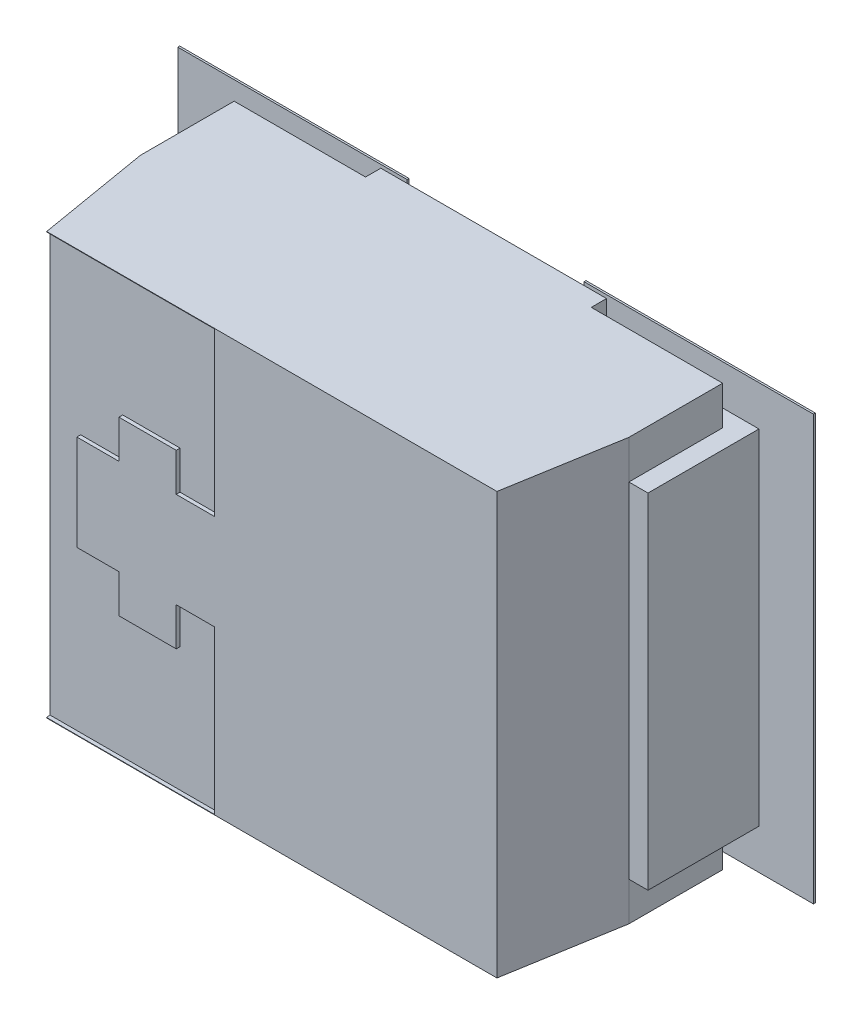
ISO-10303-21;
HEADER;
FILE_DESCRIPTION(('STEP AP214'),'2;1');
FILE_NAME('part.step','',(''),(''),'','','');
FILE_SCHEMA(('AUTOMOTIVE_DESIGN { 1 0 10303 214 1 1 1 1 }'));
ENDSEC;
DATA;
#1=APPLICATION_CONTEXT('core data for automotive mechanical design processes');
#2=APPLICATION_PROTOCOL_DEFINITION('international standard','automotive_design',2000,#1);
#3=PRODUCT_CONTEXT('',#1,'mechanical');
#4=PRODUCT('Part','Part','',(#3));
#5=PRODUCT_RELATED_PRODUCT_CATEGORY('part','',(#4));
#6=PRODUCT_DEFINITION_FORMATION('','',#4);
#7=PRODUCT_DEFINITION_CONTEXT('part definition',#1,'design');
#8=PRODUCT_DEFINITION('design','',#6,#7);
#9=PRODUCT_DEFINITION_SHAPE('','',#8);
#10=(LENGTH_UNIT() NAMED_UNIT(*) SI_UNIT(.MILLI.,.METRE.));
#11=(NAMED_UNIT(*) PLANE_ANGLE_UNIT() SI_UNIT($,.RADIAN.));
#12=(NAMED_UNIT(*) SI_UNIT($,.STERADIAN.) SOLID_ANGLE_UNIT());
#13=UNCERTAINTY_MEASURE_WITH_UNIT(LENGTH_MEASURE(1.E-05),#10,'distance_accuracy_value','');
#14=(GEOMETRIC_REPRESENTATION_CONTEXT(3) GLOBAL_UNCERTAINTY_ASSIGNED_CONTEXT((#13)) GLOBAL_UNIT_ASSIGNED_CONTEXT((#10,
#11,#12)) REPRESENTATION_CONTEXT('',''));
#15=CARTESIAN_POINT('',(0.,0.,0.));
#16=DIRECTION('',(0.,0.,1.));
#17=DIRECTION('',(1.,0.,0.));
#18=AXIS2_PLACEMENT_3D('',#15,#16,#17);
#19=CARTESIAN_POINT('',(0.,0.,1.55067));
#20=DIRECTION('',(0.,0.,1.));
#21=DIRECTION('',(1.,0.,0.));
#22=AXIS2_PLACEMENT_3D('',#19,#20,#21);
#23=PLANE('',#22);
#24=DIRECTION('',(0.,1.,0.));
#25=VECTOR('',#24,1.);
#26=CARTESIAN_POINT('',(-1.50030143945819,-1.39999999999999,1.55067));
#27=LINE('',#26,#25);
#28=CARTESIAN_POINT('',(-1.50030143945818,1.397,1.55067));
#29=VERTEX_POINT('',#28);
#30=CARTESIAN_POINT('',(-1.50030143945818,-1.397,1.55067));
#31=VERTEX_POINT('',#30);
#32=EDGE_CURVE('E325',#29,#31,#27,.F.);
#33=ORIENTED_EDGE('',*,*,#32,.T.);
#34=DIRECTION('',(1.,0.,0.));
#35=VECTOR('',#34,1.);
#36=CARTESIAN_POINT('',(0.,-1.397,1.55067));
#37=LINE('',#36,#35);
#38=CARTESIAN_POINT('',(-0.381,-1.397,1.55067));
#39=VERTEX_POINT('',#38);
#40=EDGE_CURVE('E323',#31,#39,#37,.T.);
#41=ORIENTED_EDGE('',*,*,#40,.T.);
#42=DIRECTION('',(0.,1.,0.));
#43=VECTOR('',#42,1.);
#44=CARTESIAN_POINT('',(-0.381,0.,1.55067));
#45=LINE('',#44,#43);
#46=CARTESIAN_POINT('',(-0.381,-0.3175,1.55067));
#47=VERTEX_POINT('',#46);
#48=EDGE_CURVE('E19',#39,#47,#45,.T.);
#49=ORIENTED_EDGE('',*,*,#48,.T.);
#50=DIRECTION('',(1.,0.,0.));
#51=VECTOR('',#50,1.);
#52=CARTESIAN_POINT('',(0.,-0.3175,1.55067));
#53=LINE('',#52,#51);
#54=CARTESIAN_POINT('',(-0.635,-0.3175,1.55067));
#55=VERTEX_POINT('',#54);
#56=EDGE_CURVE('E310',#47,#55,#53,.F.);
#57=ORIENTED_EDGE('',*,*,#56,.T.);
#58=DIRECTION('',(0.,1.,0.));
#59=VECTOR('',#58,1.);
#60=CARTESIAN_POINT('',(-0.635,0.,1.55067));
#61=LINE('',#60,#59);
#62=CARTESIAN_POINT('',(-0.635,-0.5715,1.55067));
#63=VERTEX_POINT('',#62);
#64=EDGE_CURVE('E315',#55,#63,#61,.F.);
#65=ORIENTED_EDGE('',*,*,#64,.T.);
#66=DIRECTION('',(1.,0.,0.));
#67=VECTOR('',#66,1.);
#68=CARTESIAN_POINT('',(0.,-0.5715,1.55067));
#69=LINE('',#68,#67);
#70=CARTESIAN_POINT('',(-1.016,-0.5715,1.55067));
#71=VERTEX_POINT('',#70);
#72=EDGE_CURVE('E362',#63,#71,#69,.F.);
#73=ORIENTED_EDGE('',*,*,#72,.T.);
#74=DIRECTION('',(0.,1.,0.));
#75=VECTOR('',#74,1.);
#76=CARTESIAN_POINT('',(-1.016,0.,1.55067));
#77=LINE('',#76,#75);
#78=CARTESIAN_POINT('',(-1.016,-0.3175,1.55067));
#79=VERTEX_POINT('',#78);
#80=EDGE_CURVE('E359',#71,#79,#77,.T.);
#81=ORIENTED_EDGE('',*,*,#80,.T.);
#82=DIRECTION('',(1.,0.,0.));
#83=VECTOR('',#82,1.);
#84=CARTESIAN_POINT('',(0.,-0.3175,1.55067));
#85=LINE('',#84,#83);
#86=CARTESIAN_POINT('',(-1.2954,-0.3175,1.55067));
#87=VERTEX_POINT('',#86);
#88=EDGE_CURVE('E356',#79,#87,#85,.F.);
#89=ORIENTED_EDGE('',*,*,#88,.T.);
#90=DIRECTION('',(0.,1.,0.));
#91=VECTOR('',#90,1.);
#92=CARTESIAN_POINT('',(-1.2954,0.,1.55067));
#93=LINE('',#92,#91);
#94=CARTESIAN_POINT('',(-1.2954,0.3175,1.55067));
#95=VERTEX_POINT('',#94);
#96=EDGE_CURVE('E353',#87,#95,#93,.T.);
#97=ORIENTED_EDGE('',*,*,#96,.T.);
#98=DIRECTION('',(1.,0.,0.));
#99=VECTOR('',#98,1.);
#100=CARTESIAN_POINT('',(0.,0.3175,1.55067));
#101=LINE('',#100,#99);
#102=CARTESIAN_POINT('',(-1.016,0.3175,1.55067));
#103=VERTEX_POINT('',#102);
#104=EDGE_CURVE('E350',#95,#103,#101,.T.);
#105=ORIENTED_EDGE('',*,*,#104,.T.);
#106=DIRECTION('',(0.,1.,0.));
#107=VECTOR('',#106,1.);
#108=CARTESIAN_POINT('',(-1.016,0.,1.55067));
#109=LINE('',#108,#107);
#110=CARTESIAN_POINT('',(-1.016,0.5715,1.55067));
#111=VERTEX_POINT('',#110);
#112=EDGE_CURVE('E347',#103,#111,#109,.T.);
#113=ORIENTED_EDGE('',*,*,#112,.T.);
#114=DIRECTION('',(1.,0.,0.));
#115=VECTOR('',#114,1.);
#116=CARTESIAN_POINT('',(0.,0.5715,1.55067));
#117=LINE('',#116,#115);
#118=CARTESIAN_POINT('',(-0.635,0.5715,1.55067));
#119=VERTEX_POINT('',#118);
#120=EDGE_CURVE('E344',#111,#119,#117,.T.);
#121=ORIENTED_EDGE('',*,*,#120,.T.);
#122=DIRECTION('',(0.,1.,0.));
#123=VECTOR('',#122,1.);
#124=CARTESIAN_POINT('',(-0.635,0.,1.55067));
#125=LINE('',#124,#123);
#126=CARTESIAN_POINT('',(-0.635,0.3175,1.55067));
#127=VERTEX_POINT('',#126);
#128=EDGE_CURVE('E341',#119,#127,#125,.F.);
#129=ORIENTED_EDGE('',*,*,#128,.T.);
#130=DIRECTION('',(1.,0.,0.));
#131=VECTOR('',#130,1.);
#132=CARTESIAN_POINT('',(0.,0.3175,1.55067));
#133=LINE('',#132,#131);
#134=CARTESIAN_POINT('',(-0.381,0.3175,1.55067));
#135=VERTEX_POINT('',#134);
#136=EDGE_CURVE('E338',#127,#135,#133,.T.);
#137=ORIENTED_EDGE('',*,*,#136,.T.);
#138=DIRECTION('',(0.,1.,0.));
#139=VECTOR('',#138,1.);
#140=CARTESIAN_POINT('',(-0.381,0.,1.55067));
#141=LINE('',#140,#139);
#142=CARTESIAN_POINT('',(-0.381,1.397,1.55067));
#143=VERTEX_POINT('',#142);
#144=EDGE_CURVE('E332',#135,#143,#141,.T.);
#145=ORIENTED_EDGE('',*,*,#144,.T.);
#146=DIRECTION('',(1.,0.,0.));
#147=VECTOR('',#146,1.);
#148=CARTESIAN_POINT('',(0.,1.397,1.55067));
#149=LINE('',#148,#147);
#150=EDGE_CURVE('E328',#143,#29,#149,.F.);
#151=ORIENTED_EDGE('',*,*,#150,.T.);
#152=EDGE_LOOP('',(#33,#41,#49,#57,#65,#73,#81,#89,#97,#105,#113,#121,#129,#137,#145,#151));
#153=FACE_BOUND('',#152,.T.);
#154=ADVANCED_FACE('F16',(#153),#23,.T.);
#155=CARTESIAN_POINT('',(-1.62300000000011,-1.39999999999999,0.826135));
#156=DIRECTION('',(0.985961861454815,0.,-0.166970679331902));
#157=DIRECTION('',(-0.166970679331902,0.,-0.985961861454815));
#158=AXIS2_PLACEMENT_3D('',#155,#156,#157);
#159=PLANE('',#158);
#160=DIRECTION('',(0.,1.,0.));
#161=VECTOR('',#160,1.);
#162=CARTESIAN_POINT('',(-1.4960000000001,-1.39999999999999,1.57607));
#163=LINE('',#162,#161);
#164=CARTESIAN_POINT('',(-1.49600000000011,1.39999999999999,1.57607));
#165=VERTEX_POINT('',#164);
#166=CARTESIAN_POINT('',(-1.49600000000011,1.397,1.57607));
#167=VERTEX_POINT('',#166);
#168=EDGE_CURVE('E623',#165,#167,#163,.F.);
#169=ORIENTED_EDGE('',*,*,#168,.F.);
#170=DIRECTION('',(-0.166970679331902,0.,-0.985961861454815));
#171=VECTOR('',#170,1.);
#172=CARTESIAN_POINT('',(-1.62300000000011,1.39999999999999,0.826135));
#173=LINE('',#172,#171);
#174=CARTESIAN_POINT('',(-1.62300000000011,1.39999999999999,0.826135));
#175=VERTEX_POINT('',#174);
#176=EDGE_CURVE('E625',#175,#165,#173,.F.);
#177=ORIENTED_EDGE('',*,*,#176,.F.);
#178=DIRECTION('',(0.,1.,0.));
#179=VECTOR('',#178,1.);
#180=CARTESIAN_POINT('',(-1.62300000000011,-1.39999999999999,0.826135));
#181=LINE('',#180,#179);
#182=CARTESIAN_POINT('',(-1.62300000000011,1.143,0.826135));
#183=VERTEX_POINT('',#182);
#184=EDGE_CURVE('E627',#183,#175,#181,.T.);
#185=ORIENTED_EDGE('',*,*,#184,.F.);
#186=DIRECTION('',(0.,1.,0.));
#187=VECTOR('',#186,1.);
#188=CARTESIAN_POINT('',(-1.62300000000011,-1.143,0.826135));
#189=LINE('',#188,#187);
#190=CARTESIAN_POINT('',(-1.62300000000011,-1.143,0.826135));
#191=VERTEX_POINT('',#190);
#192=EDGE_CURVE('E612',#191,#183,#189,.T.);
#193=ORIENTED_EDGE('',*,*,#192,.F.);
#194=DIRECTION('',(0.,1.,0.));
#195=VECTOR('',#194,1.);
#196=CARTESIAN_POINT('',(-1.62300000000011,-1.39999999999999,0.826135));
#197=LINE('',#196,#195);
#198=CARTESIAN_POINT('',(-1.62300000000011,-1.39999999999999,0.826135));
#199=VERTEX_POINT('',#198);
#200=EDGE_CURVE('E629',#199,#191,#197,.T.);
#201=ORIENTED_EDGE('',*,*,#200,.F.);
#202=DIRECTION('',(-0.166970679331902,0.,-0.985961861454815));
#203=VECTOR('',#202,1.);
#204=CARTESIAN_POINT('',(-1.62300000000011,-1.39999999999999,0.826135));
#205=LINE('',#204,#203);
#206=CARTESIAN_POINT('',(-1.49600000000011,-1.39999999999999,1.57607));
#207=VERTEX_POINT('',#206);
#208=EDGE_CURVE('E631',#207,#199,#205,.T.);
#209=ORIENTED_EDGE('',*,*,#208,.F.);
#210=DIRECTION('',(0.,1.,0.));
#211=VECTOR('',#210,1.);
#212=CARTESIAN_POINT('',(-1.4960000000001,-1.39999999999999,1.57607));
#213=LINE('',#212,#211);
#214=CARTESIAN_POINT('',(-1.49600000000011,-1.397,1.57607));
#215=VERTEX_POINT('',#214);
#216=EDGE_CURVE('E633',#215,#207,#213,.F.);
#217=ORIENTED_EDGE('',*,*,#216,.F.);
#218=DIRECTION('',(-0.166970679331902,0.,-0.985961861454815));
#219=VECTOR('',#218,1.);
#220=CARTESIAN_POINT('',(-1.62300000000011,-1.397,0.826135));
#221=LINE('',#220,#219);
#222=EDGE_CURVE('E330',#31,#215,#221,.F.);
#223=ORIENTED_EDGE('',*,*,#222,.F.);
#224=ORIENTED_EDGE('',*,*,#32,.F.);
#225=DIRECTION('',(-0.166970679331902,0.,-0.985961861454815));
#226=VECTOR('',#225,1.);
#227=CARTESIAN_POINT('',(-1.62300000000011,1.397,0.826135));
#228=LINE('',#227,#226);
#229=EDGE_CURVE('E620',#167,#29,#228,.T.);
#230=ORIENTED_EDGE('',*,*,#229,.F.);
#231=EDGE_LOOP('',(#169,#177,#185,#193,#201,#209,#217,#223,#224,#230));
#232=FACE_BOUND('',#231,.T.);
#233=ADVANCED_FACE('F646',(#232),#159,.F.);
#234=CARTESIAN_POINT('',(-0.95000000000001,-1.143,0.0762));
#235=DIRECTION('',(0.,0.,-1.));
#236=DIRECTION('',(-1.,0.,0.));
#237=AXIS2_PLACEMENT_3D('',#234,#235,#236);
#238=PLANE('',#237);
#239=DIRECTION('',(1.,0.,0.));
#240=VECTOR('',#239,1.);
#241=CARTESIAN_POINT('',(-2.11201,-1.4094968,0.0762));
#242=LINE('',#241,#240);
#243=CARTESIAN_POINT('',(-2.11201,-1.4094968,0.0762));
#244=VERTEX_POINT('',#243);
#245=CARTESIAN_POINT('',(-0.58801,-1.4094968,0.0762));
#246=VERTEX_POINT('',#245);
#247=EDGE_CURVE('E610',#244,#246,#242,.T.);
#248=ORIENTED_EDGE('',*,*,#247,.F.);
#249=DIRECTION('',(0.,1.,0.));
#250=VECTOR('',#249,1.);
#251=CARTESIAN_POINT('',(-2.11201,1.4094968,0.0762));
#252=LINE('',#251,#250);
#253=CARTESIAN_POINT('',(-2.11201,1.4094968,0.0762));
#254=VERTEX_POINT('',#253);
#255=EDGE_CURVE('E591',#254,#244,#252,.F.);
#256=ORIENTED_EDGE('',*,*,#255,.F.);
#257=DIRECTION('',(1.,0.,0.));
#258=VECTOR('',#257,1.);
#259=CARTESIAN_POINT('',(-0.58801,1.4094968,0.0762));
#260=LINE('',#259,#258);
#261=CARTESIAN_POINT('',(-0.58801,1.4094968,0.0762));
#262=VERTEX_POINT('',#261);
#263=EDGE_CURVE('E600',#262,#254,#260,.F.);
#264=ORIENTED_EDGE('',*,*,#263,.F.);
#265=DIRECTION('',(0.,1.,0.));
#266=VECTOR('',#265,1.);
#267=CARTESIAN_POINT('',(-0.58801,-1.4094968,0.0762));
#268=LINE('',#267,#266);
#269=EDGE_CURVE('E605',#246,#262,#268,.T.);
#270=ORIENTED_EDGE('',*,*,#269,.F.);
#271=EDGE_LOOP('',(#248,#256,#264,#270));
#272=FACE_BOUND('',#271,.T.);
#273=ADVANCED_FACE('F1122',(#272),#238,.T.);
#274=CARTESIAN_POINT('',(-1.75000000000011,-1.143,0.826135));
#275=DIRECTION('',(0.,0.,1.));
#276=DIRECTION('',(1.,0.,0.));
#277=AXIS2_PLACEMENT_3D('',#274,#275,#276);
#278=PLANE('',#277);
#279=DIRECTION('',(1.,0.,0.));
#280=VECTOR('',#279,1.);
#281=CARTESIAN_POINT('',(-1.75000000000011,-1.143,0.826135));
#282=LINE('',#281,#280);
#283=CARTESIAN_POINT('',(-1.75000000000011,-1.143,0.826135));
#284=VERTEX_POINT('',#283);
#285=EDGE_CURVE('E615',#284,#191,#282,.T.);
#286=ORIENTED_EDGE('',*,*,#285,.T.);
#287=ORIENTED_EDGE('',*,*,#192,.T.);
#288=DIRECTION('',(1.,0.,0.));
#289=VECTOR('',#288,1.);
#290=CARTESIAN_POINT('',(-1.75000000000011,1.143,0.826135));
#291=LINE('',#290,#289);
#292=CARTESIAN_POINT('',(-1.75000000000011,1.143,0.826135));
#293=VERTEX_POINT('',#292);
#294=EDGE_CURVE('E618',#183,#293,#291,.F.);
#295=ORIENTED_EDGE('',*,*,#294,.T.);
#296=DIRECTION('',(0.,1.,0.));
#297=VECTOR('',#296,1.);
#298=CARTESIAN_POINT('',(-1.75000000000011,-1.143,0.826135));
#299=LINE('',#298,#297);
#300=EDGE_CURVE('E585',#284,#293,#299,.T.);
#301=ORIENTED_EDGE('',*,*,#300,.F.);
#302=EDGE_LOOP('',(#286,#287,#295,#301));
#303=FACE_BOUND('',#302,.T.);
#304=ADVANCED_FACE('F806',(#303),#278,.T.);
#305=CARTESIAN_POINT('',(-2.11201,-1.4094968,0.0762));
#306=DIRECTION('',(0.,-1.,0.));
#307=DIRECTION('',(0.,0.,-1.));
#308=AXIS2_PLACEMENT_3D('',#305,#306,#307);
#309=PLANE('',#308);
#310=DIRECTION('',(0.,0.,1.));
#311=VECTOR('',#310,1.);
#312=CARTESIAN_POINT('',(-2.11201,-1.4094968,0.0762));
#313=LINE('',#312,#311);
#314=CARTESIAN_POINT('',(-2.11201,-1.4094968,0.0889));
#315=VERTEX_POINT('',#314);
#316=EDGE_CURVE('E597',#244,#315,#313,.T.);
#317=ORIENTED_EDGE('',*,*,#316,.F.);
#318=ORIENTED_EDGE('',*,*,#247,.T.);
#319=DIRECTION('',(0.,0.,-1.));
#320=VECTOR('',#319,1.);
#321=CARTESIAN_POINT('',(-0.58801,-1.4094968,0.0762));
#322=LINE('',#321,#320);
#323=CARTESIAN_POINT('',(-0.58801,-1.4094968,0.0889));
#324=VERTEX_POINT('',#323);
#325=EDGE_CURVE('E607',#324,#246,#322,.T.);
#326=ORIENTED_EDGE('',*,*,#325,.F.);
#327=DIRECTION('',(1.,0.,0.));
#328=VECTOR('',#327,1.);
#329=CARTESIAN_POINT('',(0.,-1.4094968,0.0889));
#330=LINE('',#329,#328);
#331=EDGE_CURVE('E580',#315,#324,#330,.T.);
#332=ORIENTED_EDGE('',*,*,#331,.F.);
#333=EDGE_LOOP('',(#317,#318,#326,#332));
#334=FACE_BOUND('',#333,.T.);
#335=ADVANCED_FACE('F1121',(#334),#309,.T.);
#336=CARTESIAN_POINT('',(-0.58801,-1.4094968,0.0762));
#337=DIRECTION('',(1.,0.,0.));
#338=DIRECTION('',(0.,0.,-1.));
#339=AXIS2_PLACEMENT_3D('',#336,#337,#338);
#340=PLANE('',#339);
#341=ORIENTED_EDGE('',*,*,#325,.T.);
#342=ORIENTED_EDGE('',*,*,#269,.T.);
#343=DIRECTION('',(0.,0.,1.));
#344=VECTOR('',#343,1.);
#345=CARTESIAN_POINT('',(-0.58801,1.4094968,0.0762));
#346=LINE('',#345,#344);
#347=CARTESIAN_POINT('',(-0.58801,1.4094968,0.0889));
#348=VERTEX_POINT('',#347);
#349=EDGE_CURVE('E602',#348,#262,#346,.F.);
#350=ORIENTED_EDGE('',*,*,#349,.F.);
#351=DIRECTION('',(0.,1.,0.));
#352=VECTOR('',#351,1.);
#353=CARTESIAN_POINT('',(-0.58801,0.,0.0889));
#354=LINE('',#353,#352);
#355=EDGE_CURVE('E577',#324,#348,#354,.T.);
#356=ORIENTED_EDGE('',*,*,#355,.F.);
#357=EDGE_LOOP('',(#341,#342,#350,#356));
#358=FACE_BOUND('',#357,.T.);
#359=ADVANCED_FACE('F1184',(#358),#340,.T.);
#360=CARTESIAN_POINT('',(-0.58801,1.4094968,0.0762));
#361=DIRECTION('',(0.,1.,0.));
#362=DIRECTION('',(0.,0.,1.));
#363=AXIS2_PLACEMENT_3D('',#360,#361,#362);
#364=PLANE('',#363);
#365=ORIENTED_EDGE('',*,*,#349,.T.);
#366=ORIENTED_EDGE('',*,*,#263,.T.);
#367=DIRECTION('',(0.,0.,1.));
#368=VECTOR('',#367,1.);
#369=CARTESIAN_POINT('',(-2.11201,1.4094968,0.0762));
#370=LINE('',#369,#368);
#371=CARTESIAN_POINT('',(-2.11201,1.4094968,0.0889));
#372=VERTEX_POINT('',#371);
#373=EDGE_CURVE('E594',#372,#254,#370,.F.);
#374=ORIENTED_EDGE('',*,*,#373,.F.);
#375=DIRECTION('',(1.,0.,0.));
#376=VECTOR('',#375,1.);
#377=CARTESIAN_POINT('',(0.,1.4094968,0.0889));
#378=LINE('',#377,#376);
#379=EDGE_CURVE('E574',#348,#372,#378,.F.);
#380=ORIENTED_EDGE('',*,*,#379,.F.);
#381=EDGE_LOOP('',(#365,#366,#374,#380));
#382=FACE_BOUND('',#381,.T.);
#383=ADVANCED_FACE('F1191',(#382),#364,.T.);
#384=CARTESIAN_POINT('',(-2.11201,1.4094968,0.0762));
#385=DIRECTION('',(-1.,0.,0.));
#386=DIRECTION('',(0.,0.,1.));
#387=AXIS2_PLACEMENT_3D('',#384,#385,#386);
#388=PLANE('',#387);
#389=ORIENTED_EDGE('',*,*,#373,.T.);
#390=ORIENTED_EDGE('',*,*,#255,.T.);
#391=ORIENTED_EDGE('',*,*,#316,.T.);
#392=DIRECTION('',(0.,1.,0.));
#393=VECTOR('',#392,1.);
#394=CARTESIAN_POINT('',(-2.11201,0.,0.0889));
#395=LINE('',#394,#393);
#396=EDGE_CURVE('E571',#372,#315,#395,.F.);
#397=ORIENTED_EDGE('',*,*,#396,.F.);
#398=EDGE_LOOP('',(#389,#390,#391,#397));
#399=FACE_BOUND('',#398,.T.);
#400=ADVANCED_FACE('F1109',(#399),#388,.T.);
#401=CARTESIAN_POINT('',(-1.75000000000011,-1.143,0.0762));
#402=DIRECTION('',(-1.,0.,0.));
#403=DIRECTION('',(0.,0.,1.));
#404=AXIS2_PLACEMENT_3D('',#401,#402,#403);
#405=PLANE('',#404);
#406=DIRECTION('',(0.,0.,1.));
#407=VECTOR('',#406,1.);
#408=CARTESIAN_POINT('',(-1.75000000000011,1.143,0.0762));
#409=LINE('',#408,#407);
#410=CARTESIAN_POINT('',(-1.75000000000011,1.143,0.0889));
#411=VERTEX_POINT('',#410);
#412=EDGE_CURVE('E583',#293,#411,#409,.F.);
#413=ORIENTED_EDGE('',*,*,#412,.T.);
#414=DIRECTION('',(0.,1.,0.));
#415=VECTOR('',#414,1.);
#416=CARTESIAN_POINT('',(-1.75000000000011,0.,0.0889));
#417=LINE('',#416,#415);
#418=CARTESIAN_POINT('',(-1.75000000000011,-1.143,0.0889));
#419=VERTEX_POINT('',#418);
#420=EDGE_CURVE('E568',#419,#411,#417,.T.);
#421=ORIENTED_EDGE('',*,*,#420,.F.);
#422=DIRECTION('',(0.,0.,1.));
#423=VECTOR('',#422,1.);
#424=CARTESIAN_POINT('',(-1.75000000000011,-1.143,0.0762));
#425=LINE('',#424,#423);
#426=EDGE_CURVE('E588',#419,#284,#425,.T.);
#427=ORIENTED_EDGE('',*,*,#426,.T.);
#428=ORIENTED_EDGE('',*,*,#300,.T.);
#429=EDGE_LOOP('',(#413,#421,#427,#428));
#430=FACE_BOUND('',#429,.T.);
#431=ADVANCED_FACE('F804',(#430),#405,.T.);
#432=CARTESIAN_POINT('',(0.,0.,0.0889));
#433=DIRECTION('',(0.,0.,1.));
#434=DIRECTION('',(1.,0.,0.));
#435=AXIS2_PLACEMENT_3D('',#432,#433,#434);
#436=PLANE('',#435);
#437=DIRECTION('',(0.,1.,0.));
#438=VECTOR('',#437,1.);
#439=CARTESIAN_POINT('',(-0.95000000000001,-1.143,0.0889));
#440=LINE('',#439,#438);
#441=CARTESIAN_POINT('',(-0.95000000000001,-1.143,0.0889));
#442=VERTEX_POINT('',#441);
#443=CARTESIAN_POINT('',(-0.95000000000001,1.143,0.0889));
#444=VERTEX_POINT('',#443);
#445=EDGE_CURVE('E553',#442,#444,#440,.T.);
#446=ORIENTED_EDGE('',*,*,#445,.F.);
#447=DIRECTION('',(1.,0.,0.));
#448=VECTOR('',#447,1.);
#449=CARTESIAN_POINT('',(0.,-1.143,0.0889));
#450=LINE('',#449,#448);
#451=EDGE_CURVE('E562',#442,#419,#450,.F.);
#452=ORIENTED_EDGE('',*,*,#451,.T.);
#453=ORIENTED_EDGE('',*,*,#420,.T.);
#454=DIRECTION('',(1.,0.,0.));
#455=VECTOR('',#454,1.);
#456=CARTESIAN_POINT('',(0.,1.143,0.0889));
#457=LINE('',#456,#455);
#458=EDGE_CURVE('E565',#411,#444,#457,.T.);
#459=ORIENTED_EDGE('',*,*,#458,.T.);
#460=EDGE_LOOP('',(#446,#452,#453,#459));
#461=FACE_BOUND('',#460,.T.);
#462=ORIENTED_EDGE('',*,*,#379,.T.);
#463=ORIENTED_EDGE('',*,*,#396,.T.);
#464=ORIENTED_EDGE('',*,*,#331,.T.);
#465=ORIENTED_EDGE('',*,*,#355,.T.);
#466=EDGE_LOOP('',(#462,#463,#464,#465));
#467=FACE_BOUND('',#466,.T.);
#468=ADVANCED_FACE('F798',(#461,#467),#436,.T.);
#469=CARTESIAN_POINT('',(-0.95000000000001,-1.143,0.2032));
#470=DIRECTION('',(1.,0.,0.));
#471=DIRECTION('',(0.,0.,-1.));
#472=AXIS2_PLACEMENT_3D('',#469,#470,#471);
#473=PLANE('',#472);
#474=DIRECTION('',(0.,0.,-1.));
#475=VECTOR('',#474,1.);
#476=CARTESIAN_POINT('',(-0.95000000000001,-1.143,0.2032));
#477=LINE('',#476,#475);
#478=CARTESIAN_POINT('',(-0.95000000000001,-1.143,0.2032));
#479=VERTEX_POINT('',#478);
#480=EDGE_CURVE('E556',#479,#442,#477,.T.);
#481=ORIENTED_EDGE('',*,*,#480,.T.);
#482=ORIENTED_EDGE('',*,*,#445,.T.);
#483=DIRECTION('',(0.,0.,-1.));
#484=VECTOR('',#483,1.);
#485=CARTESIAN_POINT('',(-0.95000000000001,1.143,0.2032));
#486=LINE('',#485,#484);
#487=CARTESIAN_POINT('',(-0.95000000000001,1.143,0.2032));
#488=VERTEX_POINT('',#487);
#489=EDGE_CURVE('E559',#444,#488,#486,.F.);
#490=ORIENTED_EDGE('',*,*,#489,.T.);
#491=DIRECTION('',(0.,1.,0.));
#492=VECTOR('',#491,1.);
#493=CARTESIAN_POINT('',(-0.95000000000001,-1.39999999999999,0.2032));
#494=LINE('',#493,#492);
#495=EDGE_CURVE('E538',#488,#479,#494,.F.);
#496=ORIENTED_EDGE('',*,*,#495,.T.);
#497=EDGE_LOOP('',(#481,#482,#490,#496));
#498=FACE_BOUND('',#497,.T.);
#499=ADVANCED_FACE('F795',(#498),#473,.T.);
#500=CARTESIAN_POINT('',(-0.750000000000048,-1.39999999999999,0.2032));
#501=DIRECTION('',(0.,0.,1.));
#502=DIRECTION('',(1.,0.,0.));
#503=AXIS2_PLACEMENT_3D('',#500,#501,#502);
#504=PLANE('',#503);
#505=DIRECTION('',(1.,0.,0.));
#506=VECTOR('',#505,1.);
#507=CARTESIAN_POINT('',(-0.750000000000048,1.143,0.2032));
#508=LINE('',#507,#506);
#509=CARTESIAN_POINT('',(-1.62300000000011,1.143,0.2032));
#510=VERTEX_POINT('',#509);
#511=EDGE_CURVE('E541',#510,#488,#508,.T.);
#512=ORIENTED_EDGE('',*,*,#511,.F.);
#513=DIRECTION('',(0.,1.,0.));
#514=VECTOR('',#513,1.);
#515=CARTESIAN_POINT('',(-1.62300000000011,-1.39999999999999,0.2032));
#516=LINE('',#515,#514);
#517=CARTESIAN_POINT('',(-1.62300000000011,1.39999999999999,0.2032));
#518=VERTEX_POINT('',#517);
#519=EDGE_CURVE('E543',#518,#510,#516,.F.);
#520=ORIENTED_EDGE('',*,*,#519,.F.);
#521=DIRECTION('',(1.,0.,0.));
#522=VECTOR('',#521,1.);
#523=CARTESIAN_POINT('',(-0.750000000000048,1.39999999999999,0.2032));
#524=LINE('',#523,#522);
#525=CARTESIAN_POINT('',(-0.750000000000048,1.39999999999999,0.2032));
#526=VERTEX_POINT('',#525);
#527=EDGE_CURVE('E545',#526,#518,#524,.F.);
#528=ORIENTED_EDGE('',*,*,#527,.F.);
#529=DIRECTION('',(0.,1.,0.));
#530=VECTOR('',#529,1.);
#531=CARTESIAN_POINT('',(-0.750000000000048,-1.39999999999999,0.2032));
#532=LINE('',#531,#530);
#533=CARTESIAN_POINT('',(-0.750000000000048,-1.39999999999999,0.2032));
#534=VERTEX_POINT('',#533);
#535=EDGE_CURVE('E531',#526,#534,#532,.F.);
#536=ORIENTED_EDGE('',*,*,#535,.T.);
#537=DIRECTION('',(1.,0.,0.));
#538=VECTOR('',#537,1.);
#539=CARTESIAN_POINT('',(-0.750000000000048,-1.39999999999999,0.2032));
#540=LINE('',#539,#538);
#541=CARTESIAN_POINT('',(-1.62300000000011,-1.39999999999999,0.2032));
#542=VERTEX_POINT('',#541);
#543=EDGE_CURVE('E547',#542,#534,#540,.T.);
#544=ORIENTED_EDGE('',*,*,#543,.F.);
#545=DIRECTION('',(0.,1.,0.));
#546=VECTOR('',#545,1.);
#547=CARTESIAN_POINT('',(-1.62300000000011,-1.39999999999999,0.2032));
#548=LINE('',#547,#546);
#549=CARTESIAN_POINT('',(-1.62300000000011,-1.143,0.2032));
#550=VERTEX_POINT('',#549);
#551=EDGE_CURVE('E549',#550,#542,#548,.F.);
#552=ORIENTED_EDGE('',*,*,#551,.F.);
#553=DIRECTION('',(1.,0.,0.));
#554=VECTOR('',#553,1.);
#555=CARTESIAN_POINT('',(-0.750000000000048,-1.143,0.2032));
#556=LINE('',#555,#554);
#557=EDGE_CURVE('E551',#479,#550,#556,.F.);
#558=ORIENTED_EDGE('',*,*,#557,.F.);
#559=ORIENTED_EDGE('',*,*,#495,.F.);
#560=EDGE_LOOP('',(#512,#520,#528,#536,#544,#552,#558,#559));
#561=FACE_BOUND('',#560,.T.);
#562=ADVANCED_FACE('F660',(#561),#504,.F.);
#563=CARTESIAN_POINT('',(-0.750000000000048,-1.39999999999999,0.1016));
#564=DIRECTION('',(1.,0.,0.));
#565=DIRECTION('',(0.,0.,-1.));
#566=AXIS2_PLACEMENT_3D('',#563,#564,#565);
#567=PLANE('',#566);
#568=DIRECTION('',(0.,0.,-1.));
#569=VECTOR('',#568,1.);
#570=CARTESIAN_POINT('',(-0.750000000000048,1.39999999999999,0.1016));
#571=LINE('',#570,#569);
#572=CARTESIAN_POINT('',(-0.750000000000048,1.39999999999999,0.1016));
#573=VERTEX_POINT('',#572);
#574=EDGE_CURVE('E534',#573,#526,#571,.F.);
#575=ORIENTED_EDGE('',*,*,#574,.F.);
#576=DIRECTION('',(0.,1.,0.));
#577=VECTOR('',#576,1.);
#578=CARTESIAN_POINT('',(-0.750000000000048,-1.39999999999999,0.1016));
#579=LINE('',#578,#577);
#580=CARTESIAN_POINT('',(-0.750000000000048,-1.39999999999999,0.1016));
#581=VERTEX_POINT('',#580);
#582=EDGE_CURVE('E524',#573,#581,#579,.F.);
#583=ORIENTED_EDGE('',*,*,#582,.T.);
#584=DIRECTION('',(0.,0.,-1.));
#585=VECTOR('',#584,1.);
#586=CARTESIAN_POINT('',(-0.750000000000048,-1.39999999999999,0.1016));
#587=LINE('',#586,#585);
#588=EDGE_CURVE('E536',#534,#581,#587,.T.);
#589=ORIENTED_EDGE('',*,*,#588,.F.);
#590=ORIENTED_EDGE('',*,*,#535,.F.);
#591=EDGE_LOOP('',(#575,#583,#589,#590));
#592=FACE_BOUND('',#591,.T.);
#593=ADVANCED_FACE('F669',(#592),#567,.F.);
#594=CARTESIAN_POINT('',(0.750000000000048,-1.39999999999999,0.1016));
#595=DIRECTION('',(0.,0.,1.));
#596=DIRECTION('',(1.,0.,0.));
#597=AXIS2_PLACEMENT_3D('',#594,#595,#596);
#598=PLANE('',#597);
#599=DIRECTION('',(1.,0.,0.));
#600=VECTOR('',#599,1.);
#601=CARTESIAN_POINT('',(0.750000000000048,1.39999999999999,0.1016));
#602=LINE('',#601,#600);
#603=CARTESIAN_POINT('',(0.750000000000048,1.39999999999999,0.1016));
#604=VERTEX_POINT('',#603);
#605=EDGE_CURVE('E527',#604,#573,#602,.F.);
#606=ORIENTED_EDGE('',*,*,#605,.F.);
#607=DIRECTION('',(0.,1.,0.));
#608=VECTOR('',#607,1.);
#609=CARTESIAN_POINT('',(0.750000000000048,-1.39999999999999,0.1016));
#610=LINE('',#609,#608);
#611=CARTESIAN_POINT('',(0.750000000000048,-1.39999999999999,0.1016));
#612=VERTEX_POINT('',#611);
#613=EDGE_CURVE('E517',#604,#612,#610,.F.);
#614=ORIENTED_EDGE('',*,*,#613,.T.);
#615=DIRECTION('',(1.,0.,0.));
#616=VECTOR('',#615,1.);
#617=CARTESIAN_POINT('',(0.750000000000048,-1.39999999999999,0.1016));
#618=LINE('',#617,#616);
#619=EDGE_CURVE('E529',#581,#612,#618,.T.);
#620=ORIENTED_EDGE('',*,*,#619,.F.);
#621=ORIENTED_EDGE('',*,*,#582,.F.);
#622=EDGE_LOOP('',(#606,#614,#620,#621));
#623=FACE_BOUND('',#622,.T.);
#624=ADVANCED_FACE('F672',(#623),#598,.F.);
#625=CARTESIAN_POINT('',(0.750000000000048,-1.39999999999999,0.2032));
#626=DIRECTION('',(-1.,0.,0.));
#627=DIRECTION('',(0.,0.,1.));
#628=AXIS2_PLACEMENT_3D('',#625,#626,#627);
#629=PLANE('',#628);
#630=DIRECTION('',(0.,0.,1.));
#631=VECTOR('',#630,1.);
#632=CARTESIAN_POINT('',(0.750000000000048,1.39999999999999,0.2032));
#633=LINE('',#632,#631);
#634=CARTESIAN_POINT('',(0.750000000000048,1.39999999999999,0.2032));
#635=VERTEX_POINT('',#634);
#636=EDGE_CURVE('E520',#635,#604,#633,.F.);
#637=ORIENTED_EDGE('',*,*,#636,.F.);
#638=DIRECTION('',(0.,1.,0.));
#639=VECTOR('',#638,1.);
#640=CARTESIAN_POINT('',(0.750000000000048,-1.39999999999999,0.2032));
#641=LINE('',#640,#639);
#642=CARTESIAN_POINT('',(0.750000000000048,-1.39999999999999,0.2032));
#643=VERTEX_POINT('',#642);
#644=EDGE_CURVE('E506',#635,#643,#641,.F.);
#645=ORIENTED_EDGE('',*,*,#644,.T.);
#646=DIRECTION('',(0.,0.,1.));
#647=VECTOR('',#646,1.);
#648=CARTESIAN_POINT('',(0.750000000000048,-1.39999999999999,0.2032));
#649=LINE('',#648,#647);
#650=EDGE_CURVE('E522',#612,#643,#649,.T.);
#651=ORIENTED_EDGE('',*,*,#650,.F.);
#652=ORIENTED_EDGE('',*,*,#613,.F.);
#653=EDGE_LOOP('',(#637,#645,#651,#652));
#654=FACE_BOUND('',#653,.T.);
#655=ADVANCED_FACE('F677',(#654),#629,.F.);
#656=CARTESIAN_POINT('',(-0.95000000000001,-1.143,0.0762));
#657=DIRECTION('',(0.,0.,-1.));
#658=DIRECTION('',(-1.,0.,0.));
#659=AXIS2_PLACEMENT_3D('',#656,#657,#658);
#660=PLANE('',#659);
#661=DIRECTION('',(1.,0.,0.));
#662=VECTOR('',#661,1.);
#663=CARTESIAN_POINT('',(2.11201,1.4094968,0.0762));
#664=LINE('',#663,#662);
#665=CARTESIAN_POINT('',(2.11201,1.4094968,0.0762));
#666=VERTEX_POINT('',#665);
#667=CARTESIAN_POINT('',(0.58801,1.4094968,0.0762));
#668=VERTEX_POINT('',#667);
#669=EDGE_CURVE('E500',#666,#668,#664,.F.);
#670=ORIENTED_EDGE('',*,*,#669,.F.);
#671=DIRECTION('',(0.,1.,0.));
#672=VECTOR('',#671,1.);
#673=CARTESIAN_POINT('',(2.11201,-1.4094968,0.0762));
#674=LINE('',#673,#672);
#675=CARTESIAN_POINT('',(2.11201,-1.4094968,0.0762));
#676=VERTEX_POINT('',#675);
#677=EDGE_CURVE('E481',#676,#666,#674,.T.);
#678=ORIENTED_EDGE('',*,*,#677,.F.);
#679=DIRECTION('',(1.,0.,0.));
#680=VECTOR('',#679,1.);
#681=CARTESIAN_POINT('',(0.58801,-1.4094968,0.0762));
#682=LINE('',#681,#680);
#683=CARTESIAN_POINT('',(0.58801,-1.4094968,0.0762));
#684=VERTEX_POINT('',#683);
#685=EDGE_CURVE('E490',#684,#676,#682,.T.);
#686=ORIENTED_EDGE('',*,*,#685,.F.);
#687=DIRECTION('',(0.,1.,0.));
#688=VECTOR('',#687,1.);
#689=CARTESIAN_POINT('',(0.58801,1.4094968,0.0762));
#690=LINE('',#689,#688);
#691=EDGE_CURVE('E495',#668,#684,#690,.F.);
#692=ORIENTED_EDGE('',*,*,#691,.F.);
#693=EDGE_LOOP('',(#670,#678,#686,#692));
#694=FACE_BOUND('',#693,.T.);
#695=ADVANCED_FACE('F1063',(#694),#660,.T.);
#696=CARTESIAN_POINT('',(1.75000000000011,-1.39999999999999,0.2032));
#697=DIRECTION('',(0.,0.,1.));
#698=DIRECTION('',(1.,0.,0.));
#699=AXIS2_PLACEMENT_3D('',#696,#697,#698);
#700=PLANE('',#699);
#701=DIRECTION('',(1.,0.,0.));
#702=VECTOR('',#701,1.);
#703=CARTESIAN_POINT('',(1.75000000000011,-1.39999999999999,0.2032));
#704=LINE('',#703,#702);
#705=CARTESIAN_POINT('',(1.62300000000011,-1.39999999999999,0.2032));
#706=VERTEX_POINT('',#705);
#707=EDGE_CURVE('E504',#643,#706,#704,.T.);
#708=ORIENTED_EDGE('',*,*,#707,.F.);
#709=ORIENTED_EDGE('',*,*,#644,.F.);
#710=DIRECTION('',(1.,0.,0.));
#711=VECTOR('',#710,1.);
#712=CARTESIAN_POINT('',(1.75000000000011,1.39999999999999,0.2032));
#713=LINE('',#712,#711);
#714=CARTESIAN_POINT('',(1.62300000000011,1.39999999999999,0.2032));
#715=VERTEX_POINT('',#714);
#716=EDGE_CURVE('E509',#715,#635,#713,.F.);
#717=ORIENTED_EDGE('',*,*,#716,.F.);
#718=DIRECTION('',(0.,1.,0.));
#719=VECTOR('',#718,1.);
#720=CARTESIAN_POINT('',(1.62300000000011,-1.39999999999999,0.2032));
#721=LINE('',#720,#719);
#722=CARTESIAN_POINT('',(1.62300000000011,1.143,0.2032));
#723=VERTEX_POINT('',#722);
#724=EDGE_CURVE('E511',#723,#715,#721,.T.);
#725=ORIENTED_EDGE('',*,*,#724,.F.);
#726=DIRECTION('',(1.,0.,0.));
#727=VECTOR('',#726,1.);
#728=CARTESIAN_POINT('',(1.75000000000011,1.143,0.2032));
#729=LINE('',#728,#727);
#730=CARTESIAN_POINT('',(0.95000000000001,1.143,0.2032));
#731=VERTEX_POINT('',#730);
#732=EDGE_CURVE('E513',#731,#723,#729,.T.);
#733=ORIENTED_EDGE('',*,*,#732,.F.);
#734=DIRECTION('',(0.,1.,0.));
#735=VECTOR('',#734,1.);
#736=CARTESIAN_POINT('',(0.95000000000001,-1.143,0.2032));
#737=LINE('',#736,#735);
#738=CARTESIAN_POINT('',(0.95000000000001,-1.143,0.2032));
#739=VERTEX_POINT('',#738);
#740=EDGE_CURVE('E475',#739,#731,#737,.T.);
#741=ORIENTED_EDGE('',*,*,#740,.F.);
#742=DIRECTION('',(1.,0.,0.));
#743=VECTOR('',#742,1.);
#744=CARTESIAN_POINT('',(1.75000000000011,-1.143,0.2032));
#745=LINE('',#744,#743);
#746=CARTESIAN_POINT('',(1.62300000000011,-1.143,0.2032));
#747=VERTEX_POINT('',#746);
#748=EDGE_CURVE('E515',#747,#739,#745,.F.);
#749=ORIENTED_EDGE('',*,*,#748,.F.);
#750=DIRECTION('',(0.,1.,0.));
#751=VECTOR('',#750,1.);
#752=CARTESIAN_POINT('',(1.62300000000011,-1.39999999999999,0.2032));
#753=LINE('',#752,#751);
#754=EDGE_CURVE('E502',#706,#747,#753,.T.);
#755=ORIENTED_EDGE('',*,*,#754,.F.);
#756=EDGE_LOOP('',(#708,#709,#717,#725,#733,#741,#749,#755));
#757=FACE_BOUND('',#756,.T.);
#758=ADVANCED_FACE('F689',(#757),#700,.F.);
#759=CARTESIAN_POINT('',(2.11201,1.4094968,0.0762));
#760=DIRECTION('',(0.,1.,0.));
#761=DIRECTION('',(0.,0.,1.));
#762=AXIS2_PLACEMENT_3D('',#759,#760,#761);
#763=PLANE('',#762);
#764=DIRECTION('',(0.,0.,-1.));
#765=VECTOR('',#764,1.);
#766=CARTESIAN_POINT('',(2.11201,1.4094968,0.0762));
#767=LINE('',#766,#765);
#768=CARTESIAN_POINT('',(2.11201,1.4094968,0.0889));
#769=VERTEX_POINT('',#768);
#770=EDGE_CURVE('E487',#666,#769,#767,.F.);
#771=ORIENTED_EDGE('',*,*,#770,.F.);
#772=ORIENTED_EDGE('',*,*,#669,.T.);
#773=DIRECTION('',(0.,0.,1.));
#774=VECTOR('',#773,1.);
#775=CARTESIAN_POINT('',(0.58801,1.4094968,0.0762));
#776=LINE('',#775,#774);
#777=CARTESIAN_POINT('',(0.58801,1.4094968,0.0889));
#778=VERTEX_POINT('',#777);
#779=EDGE_CURVE('E497',#778,#668,#776,.F.);
#780=ORIENTED_EDGE('',*,*,#779,.F.);
#781=DIRECTION('',(1.,0.,0.));
#782=VECTOR('',#781,1.);
#783=CARTESIAN_POINT('',(0.,1.4094968,0.0889));
#784=LINE('',#783,#782);
#785=EDGE_CURVE('E470',#769,#778,#784,.F.);
#786=ORIENTED_EDGE('',*,*,#785,.F.);
#787=EDGE_LOOP('',(#771,#772,#780,#786));
#788=FACE_BOUND('',#787,.T.);
#789=ADVANCED_FACE('F1062',(#788),#763,.T.);
#790=CARTESIAN_POINT('',(0.58801,1.4094968,0.0762));
#791=DIRECTION('',(-1.,0.,0.));
#792=DIRECTION('',(0.,0.,1.));
#793=AXIS2_PLACEMENT_3D('',#790,#791,#792);
#794=PLANE('',#793);
#795=ORIENTED_EDGE('',*,*,#779,.T.);
#796=ORIENTED_EDGE('',*,*,#691,.T.);
#797=DIRECTION('',(0.,0.,-1.));
#798=VECTOR('',#797,1.);
#799=CARTESIAN_POINT('',(0.58801,-1.4094968,0.0762));
#800=LINE('',#799,#798);
#801=CARTESIAN_POINT('',(0.58801,-1.4094968,0.0889));
#802=VERTEX_POINT('',#801);
#803=EDGE_CURVE('E492',#802,#684,#800,.T.);
#804=ORIENTED_EDGE('',*,*,#803,.F.);
#805=DIRECTION('',(0.,1.,0.));
#806=VECTOR('',#805,1.);
#807=CARTESIAN_POINT('',(0.58801,0.,0.0889));
#808=LINE('',#807,#806);
#809=EDGE_CURVE('E467',#778,#802,#808,.F.);
#810=ORIENTED_EDGE('',*,*,#809,.F.);
#811=EDGE_LOOP('',(#795,#796,#804,#810));
#812=FACE_BOUND('',#811,.T.);
#813=ADVANCED_FACE('F1233',(#812),#794,.T.);
#814=CARTESIAN_POINT('',(0.58801,-1.4094968,0.0762));
#815=DIRECTION('',(0.,-1.,0.));
#816=DIRECTION('',(0.,0.,-1.));
#817=AXIS2_PLACEMENT_3D('',#814,#815,#816);
#818=PLANE('',#817);
#819=ORIENTED_EDGE('',*,*,#803,.T.);
#820=ORIENTED_EDGE('',*,*,#685,.T.);
#821=DIRECTION('',(0.,0.,-1.));
#822=VECTOR('',#821,1.);
#823=CARTESIAN_POINT('',(2.11201,-1.4094968,0.0762));
#824=LINE('',#823,#822);
#825=CARTESIAN_POINT('',(2.11201,-1.4094968,0.0889));
#826=VERTEX_POINT('',#825);
#827=EDGE_CURVE('E484',#826,#676,#824,.T.);
#828=ORIENTED_EDGE('',*,*,#827,.F.);
#829=DIRECTION('',(1.,0.,0.));
#830=VECTOR('',#829,1.);
#831=CARTESIAN_POINT('',(0.,-1.4094968,0.0889));
#832=LINE('',#831,#830);
#833=EDGE_CURVE('E464',#802,#826,#832,.T.);
#834=ORIENTED_EDGE('',*,*,#833,.F.);
#835=EDGE_LOOP('',(#819,#820,#828,#834));
#836=FACE_BOUND('',#835,.T.);
#837=ADVANCED_FACE('F1240',(#836),#818,.T.);
#838=CARTESIAN_POINT('',(2.11201,-1.4094968,0.0762));
#839=DIRECTION('',(1.,0.,0.));
#840=DIRECTION('',(0.,0.,-1.));
#841=AXIS2_PLACEMENT_3D('',#838,#839,#840);
#842=PLANE('',#841);
#843=ORIENTED_EDGE('',*,*,#827,.T.);
#844=ORIENTED_EDGE('',*,*,#677,.T.);
#845=ORIENTED_EDGE('',*,*,#770,.T.);
#846=DIRECTION('',(0.,1.,0.));
#847=VECTOR('',#846,1.);
#848=CARTESIAN_POINT('',(2.11201,0.,0.0889));
#849=LINE('',#848,#847);
#850=EDGE_CURVE('E461',#826,#769,#849,.T.);
#851=ORIENTED_EDGE('',*,*,#850,.F.);
#852=EDGE_LOOP('',(#843,#844,#845,#851));
#853=FACE_BOUND('',#852,.T.);
#854=ADVANCED_FACE('F1248',(#853),#842,.T.);
#855=CARTESIAN_POINT('',(0.95000000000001,-1.143,0.0762));
#856=DIRECTION('',(-1.,0.,0.));
#857=DIRECTION('',(0.,0.,1.));
#858=AXIS2_PLACEMENT_3D('',#855,#856,#857);
#859=PLANE('',#858);
#860=DIRECTION('',(0.,0.,1.));
#861=VECTOR('',#860,1.);
#862=CARTESIAN_POINT('',(0.95000000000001,1.143,0.0762));
#863=LINE('',#862,#861);
#864=CARTESIAN_POINT('',(0.95000000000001,1.143,0.0889));
#865=VERTEX_POINT('',#864);
#866=EDGE_CURVE('E473',#731,#865,#863,.F.);
#867=ORIENTED_EDGE('',*,*,#866,.T.);
#868=DIRECTION('',(0.,1.,0.));
#869=VECTOR('',#868,1.);
#870=CARTESIAN_POINT('',(0.95000000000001,0.,0.0889));
#871=LINE('',#870,#869);
#872=CARTESIAN_POINT('',(0.95000000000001,-1.143,0.0889));
#873=VERTEX_POINT('',#872);
#874=EDGE_CURVE('E458',#873,#865,#871,.T.);
#875=ORIENTED_EDGE('',*,*,#874,.F.);
#876=DIRECTION('',(0.,0.,1.));
#877=VECTOR('',#876,1.);
#878=CARTESIAN_POINT('',(0.95000000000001,-1.143,0.0762));
#879=LINE('',#878,#877);
#880=EDGE_CURVE('E478',#873,#739,#879,.T.);
#881=ORIENTED_EDGE('',*,*,#880,.T.);
#882=ORIENTED_EDGE('',*,*,#740,.T.);
#883=EDGE_LOOP('',(#867,#875,#881,#882));
#884=FACE_BOUND('',#883,.T.);
#885=ADVANCED_FACE('F820',(#884),#859,.T.);
#886=CARTESIAN_POINT('',(0.,0.,0.0889));
#887=DIRECTION('',(0.,0.,1.));
#888=DIRECTION('',(1.,0.,0.));
#889=AXIS2_PLACEMENT_3D('',#886,#887,#888);
#890=PLANE('',#889);
#891=DIRECTION('',(0.,1.,0.));
#892=VECTOR('',#891,1.);
#893=CARTESIAN_POINT('',(1.75000000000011,-1.143,0.0889));
#894=LINE('',#893,#892);
#895=CARTESIAN_POINT('',(1.75000000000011,-1.143,0.0889));
#896=VERTEX_POINT('',#895);
#897=CARTESIAN_POINT('',(1.75000000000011,1.143,0.0889));
#898=VERTEX_POINT('',#897);
#899=EDGE_CURVE('E450',#896,#898,#894,.T.);
#900=ORIENTED_EDGE('',*,*,#899,.F.);
#901=DIRECTION('',(1.,0.,0.));
#902=VECTOR('',#901,1.);
#903=CARTESIAN_POINT('',(0.,-1.143,0.0889));
#904=LINE('',#903,#902);
#905=EDGE_CURVE('E453',#896,#873,#904,.F.);
#906=ORIENTED_EDGE('',*,*,#905,.T.);
#907=ORIENTED_EDGE('',*,*,#874,.T.);
#908=DIRECTION('',(1.,0.,0.));
#909=VECTOR('',#908,1.);
#910=CARTESIAN_POINT('',(0.,1.143,0.0889));
#911=LINE('',#910,#909);
#912=EDGE_CURVE('E456',#865,#898,#911,.T.);
#913=ORIENTED_EDGE('',*,*,#912,.T.);
#914=EDGE_LOOP('',(#900,#906,#907,#913));
#915=FACE_BOUND('',#914,.T.);
#916=ORIENTED_EDGE('',*,*,#833,.T.);
#917=ORIENTED_EDGE('',*,*,#850,.T.);
#918=ORIENTED_EDGE('',*,*,#785,.T.);
#919=ORIENTED_EDGE('',*,*,#809,.T.);
#920=EDGE_LOOP('',(#916,#917,#918,#919));
#921=FACE_BOUND('',#920,.T.);
#922=ADVANCED_FACE('F811',(#915,#921),#890,.T.);
#923=CARTESIAN_POINT('',(0.,-1.143,0.));
#924=DIRECTION('',(0.,1.,0.));
#925=DIRECTION('',(0.,0.,1.));
#926=AXIS2_PLACEMENT_3D('',#923,#924,#925);
#927=PLANE('',#926);
#928=ORIENTED_EDGE('',*,*,#557,.T.);
#929=DIRECTION('',(0.,0.,-1.));
#930=VECTOR('',#929,1.);
#931=CARTESIAN_POINT('',(-1.62300000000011,-1.143,0.0762));
#932=LINE('',#931,#930);
#933=EDGE_CURVE('E441',#550,#191,#932,.F.);
#934=ORIENTED_EDGE('',*,*,#933,.T.);
#935=ORIENTED_EDGE('',*,*,#285,.F.);
#936=ORIENTED_EDGE('',*,*,#426,.F.);
#937=ORIENTED_EDGE('',*,*,#451,.F.);
#938=ORIENTED_EDGE('',*,*,#480,.F.);
#939=EDGE_LOOP('',(#928,#934,#935,#936,#937,#938));
#940=FACE_BOUND('',#939,.T.);
#941=ADVANCED_FACE('F808',(#940),#927,.F.);
#942=CARTESIAN_POINT('',(1.75000000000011,-1.143,0.826135));
#943=DIRECTION('',(1.,0.,0.));
#944=DIRECTION('',(0.,0.,-1.));
#945=AXIS2_PLACEMENT_3D('',#942,#943,#944);
#946=PLANE('',#945);
#947=DIRECTION('',(0.,0.,1.));
#948=VECTOR('',#947,1.);
#949=CARTESIAN_POINT('',(1.75000000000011,-1.143,0.));
#950=LINE('',#949,#948);
#951=CARTESIAN_POINT('',(1.75000000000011,-1.143,0.826135));
#952=VERTEX_POINT('',#951);
#953=EDGE_CURVE('E447',#952,#896,#950,.F.);
#954=ORIENTED_EDGE('',*,*,#953,.T.);
#955=ORIENTED_EDGE('',*,*,#899,.T.);
#956=DIRECTION('',(0.,0.,1.));
#957=VECTOR('',#956,1.);
#958=CARTESIAN_POINT('',(1.75000000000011,1.143,0.));
#959=LINE('',#958,#957);
#960=CARTESIAN_POINT('',(1.75000000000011,1.143,0.826135));
#961=VERTEX_POINT('',#960);
#962=EDGE_CURVE('E444',#961,#898,#959,.F.);
#963=ORIENTED_EDGE('',*,*,#962,.F.);
#964=DIRECTION('',(0.,1.,0.));
#965=VECTOR('',#964,1.);
#966=CARTESIAN_POINT('',(1.75000000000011,-1.143,0.826135));
#967=LINE('',#966,#965);
#968=EDGE_CURVE('E435',#952,#961,#967,.T.);
#969=ORIENTED_EDGE('',*,*,#968,.F.);
#970=EDGE_LOOP('',(#954,#955,#963,#969));
#971=FACE_BOUND('',#970,.T.);
#972=ADVANCED_FACE('F810',(#971),#946,.T.);
#973=CARTESIAN_POINT('',(0.,-1.143,0.));
#974=DIRECTION('',(0.,1.,0.));
#975=DIRECTION('',(0.,0.,1.));
#976=AXIS2_PLACEMENT_3D('',#973,#974,#975);
#977=PLANE('',#976);
#978=DIRECTION('',(1.,0.,0.));
#979=VECTOR('',#978,1.);
#980=CARTESIAN_POINT('',(1.62300000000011,-1.143,0.826135));
#981=LINE('',#980,#979);
#982=CARTESIAN_POINT('',(1.62300000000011,-1.143,0.826135));
#983=VERTEX_POINT('',#982);
#984=EDGE_CURVE('E438',#983,#952,#981,.T.);
#985=ORIENTED_EDGE('',*,*,#984,.F.);
#986=DIRECTION('',(0.,0.,1.));
#987=VECTOR('',#986,1.);
#988=CARTESIAN_POINT('',(1.62300000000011,-1.143,0.826135));
#989=LINE('',#988,#987);
#990=EDGE_CURVE('E429',#983,#747,#989,.F.);
#991=ORIENTED_EDGE('',*,*,#990,.T.);
#992=ORIENTED_EDGE('',*,*,#748,.T.);
#993=ORIENTED_EDGE('',*,*,#880,.F.);
#994=ORIENTED_EDGE('',*,*,#905,.F.);
#995=ORIENTED_EDGE('',*,*,#953,.F.);
#996=EDGE_LOOP('',(#985,#991,#992,#993,#994,#995));
#997=FACE_BOUND('',#996,.T.);
#998=ADVANCED_FACE('F692',(#997),#977,.F.);
#999=CARTESIAN_POINT('',(0.,1.143,0.));
#1000=DIRECTION('',(0.,1.,0.));
#1001=DIRECTION('',(0.,0.,1.));
#1002=AXIS2_PLACEMENT_3D('',#999,#1000,#1001);
#1003=PLANE('',#1002);
#1004=ORIENTED_EDGE('',*,*,#489,.F.);
#1005=ORIENTED_EDGE('',*,*,#458,.F.);
#1006=ORIENTED_EDGE('',*,*,#412,.F.);
#1007=ORIENTED_EDGE('',*,*,#294,.F.);
#1008=DIRECTION('',(0.,0.,-1.));
#1009=VECTOR('',#1008,1.);
#1010=CARTESIAN_POINT('',(-1.62300000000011,1.143,0.0762));
#1011=LINE('',#1010,#1009);
#1012=EDGE_CURVE('E426',#183,#510,#1011,.T.);
#1013=ORIENTED_EDGE('',*,*,#1012,.T.);
#1014=ORIENTED_EDGE('',*,*,#511,.T.);
#1015=EDGE_LOOP('',(#1004,#1005,#1006,#1007,#1013,#1014));
#1016=FACE_BOUND('',#1015,.T.);
#1017=ADVANCED_FACE('F792',(#1016),#1003,.T.);
#1018=CARTESIAN_POINT('',(0.,1.143,0.));
#1019=DIRECTION('',(0.,1.,0.));
#1020=DIRECTION('',(0.,0.,1.));
#1021=AXIS2_PLACEMENT_3D('',#1018,#1019,#1020);
#1022=PLANE('',#1021);
#1023=ORIENTED_EDGE('',*,*,#962,.T.);
#1024=ORIENTED_EDGE('',*,*,#912,.F.);
#1025=ORIENTED_EDGE('',*,*,#866,.F.);
#1026=ORIENTED_EDGE('',*,*,#732,.T.);
#1027=DIRECTION('',(0.,0.,1.));
#1028=VECTOR('',#1027,1.);
#1029=CARTESIAN_POINT('',(1.62300000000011,1.143,0.826135));
#1030=LINE('',#1029,#1028);
#1031=CARTESIAN_POINT('',(1.62300000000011,1.143,0.826135));
#1032=VERTEX_POINT('',#1031);
#1033=EDGE_CURVE('E424',#723,#1032,#1030,.T.);
#1034=ORIENTED_EDGE('',*,*,#1033,.T.);
#1035=DIRECTION('',(1.,0.,0.));
#1036=VECTOR('',#1035,1.);
#1037=CARTESIAN_POINT('',(1.62300000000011,1.143,0.826135));
#1038=LINE('',#1037,#1036);
#1039=EDGE_CURVE('E432',#961,#1032,#1038,.F.);
#1040=ORIENTED_EDGE('',*,*,#1039,.F.);
#1041=EDGE_LOOP('',(#1023,#1024,#1025,#1026,#1034,#1040));
#1042=FACE_BOUND('',#1041,.T.);
#1043=ADVANCED_FACE('F878',(#1042),#1022,.T.);
#1044=CARTESIAN_POINT('',(-1.62300000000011,-1.39999999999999,0.0762));
#1045=DIRECTION('',(1.,0.,0.));
#1046=DIRECTION('',(0.,0.,-1.));
#1047=AXIS2_PLACEMENT_3D('',#1044,#1045,#1046);
#1048=PLANE('',#1047);
#1049=DIRECTION('',(0.,0.,-1.));
#1050=VECTOR('',#1049,1.);
#1051=CARTESIAN_POINT('',(-1.62300000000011,-1.39999999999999,0.0762));
#1052=LINE('',#1051,#1050);
#1053=EDGE_CURVE('E418',#199,#542,#1052,.T.);
#1054=ORIENTED_EDGE('',*,*,#1053,.F.);
#1055=ORIENTED_EDGE('',*,*,#200,.T.);
#1056=ORIENTED_EDGE('',*,*,#933,.F.);
#1057=ORIENTED_EDGE('',*,*,#551,.T.);
#1058=EDGE_LOOP('',(#1054,#1055,#1056,#1057));
#1059=FACE_BOUND('',#1058,.T.);
#1060=ADVANCED_FACE('F654',(#1059),#1048,.F.);
#1061=CARTESIAN_POINT('',(1.62300000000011,-1.143,0.826135));
#1062=DIRECTION('',(0.,0.,1.));
#1063=DIRECTION('',(1.,0.,0.));
#1064=AXIS2_PLACEMENT_3D('',#1061,#1062,#1063);
#1065=PLANE('',#1064);
#1066=ORIENTED_EDGE('',*,*,#1039,.T.);
#1067=DIRECTION('',(0.,1.,0.));
#1068=VECTOR('',#1067,1.);
#1069=CARTESIAN_POINT('',(1.62300000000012,-1.39999999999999,0.826135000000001));
#1070=LINE('',#1069,#1068);
#1071=EDGE_CURVE('E415',#1032,#983,#1070,.F.);
#1072=ORIENTED_EDGE('',*,*,#1071,.T.);
#1073=ORIENTED_EDGE('',*,*,#984,.T.);
#1074=ORIENTED_EDGE('',*,*,#968,.T.);
#1075=EDGE_LOOP('',(#1066,#1072,#1073,#1074));
#1076=FACE_BOUND('',#1075,.T.);
#1077=ADVANCED_FACE('F872',(#1076),#1065,.T.);
#1078=CARTESIAN_POINT('',(1.62300000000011,-1.39999999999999,0.826135));
#1079=DIRECTION('',(-1.,0.,0.));
#1080=DIRECTION('',(0.,0.,1.));
#1081=AXIS2_PLACEMENT_3D('',#1078,#1079,#1080);
#1082=PLANE('',#1081);
#1083=DIRECTION('',(0.,0.,-1.));
#1084=VECTOR('',#1083,1.);
#1085=CARTESIAN_POINT('',(1.62300000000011,-1.39999999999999,0.0762));
#1086=LINE('',#1085,#1084);
#1087=CARTESIAN_POINT('',(1.62300000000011,-1.39999999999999,0.826135));
#1088=VERTEX_POINT('',#1087);
#1089=EDGE_CURVE('E421',#706,#1088,#1086,.F.);
#1090=ORIENTED_EDGE('',*,*,#1089,.F.);
#1091=ORIENTED_EDGE('',*,*,#754,.T.);
#1092=ORIENTED_EDGE('',*,*,#990,.F.);
#1093=DIRECTION('',(0.,1.,0.));
#1094=VECTOR('',#1093,1.);
#1095=CARTESIAN_POINT('',(1.62300000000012,-1.39999999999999,0.826135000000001));
#1096=LINE('',#1095,#1094);
#1097=EDGE_CURVE('E413',#983,#1088,#1096,.F.);
#1098=ORIENTED_EDGE('',*,*,#1097,.T.);
#1099=EDGE_LOOP('',(#1090,#1091,#1092,#1098));
#1100=FACE_BOUND('',#1099,.T.);
#1101=ADVANCED_FACE('F685',(#1100),#1082,.F.);
#1102=CARTESIAN_POINT('',(-1.62300000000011,-1.39999999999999,0.0762));
#1103=DIRECTION('',(1.,0.,0.));
#1104=DIRECTION('',(0.,0.,-1.));
#1105=AXIS2_PLACEMENT_3D('',#1102,#1103,#1104);
#1106=PLANE('',#1105);
#1107=DIRECTION('',(0.,0.,1.));
#1108=VECTOR('',#1107,1.);
#1109=CARTESIAN_POINT('',(-1.62300000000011,1.39999999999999,0.0762));
#1110=LINE('',#1109,#1108);
#1111=EDGE_CURVE('E405',#518,#175,#1110,.T.);
#1112=ORIENTED_EDGE('',*,*,#1111,.F.);
#1113=ORIENTED_EDGE('',*,*,#519,.T.);
#1114=ORIENTED_EDGE('',*,*,#1012,.F.);
#1115=ORIENTED_EDGE('',*,*,#184,.T.);
#1116=EDGE_LOOP('',(#1112,#1113,#1114,#1115));
#1117=FACE_BOUND('',#1116,.T.);
#1118=ADVANCED_FACE('F789',(#1117),#1106,.F.);
#1119=CARTESIAN_POINT('',(1.62300000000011,-1.39999999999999,0.826135));
#1120=DIRECTION('',(-1.,0.,0.));
#1121=DIRECTION('',(0.,0.,1.));
#1122=AXIS2_PLACEMENT_3D('',#1119,#1120,#1121);
#1123=PLANE('',#1122);
#1124=DIRECTION('',(0.,0.,1.));
#1125=VECTOR('',#1124,1.);
#1126=CARTESIAN_POINT('',(1.62300000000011,1.39999999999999,0.0762));
#1127=LINE('',#1126,#1125);
#1128=CARTESIAN_POINT('',(1.62300000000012,1.39999999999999,0.826135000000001));
#1129=VERTEX_POINT('',#1128);
#1130=EDGE_CURVE('E399',#1129,#715,#1127,.F.);
#1131=ORIENTED_EDGE('',*,*,#1130,.F.);
#1132=DIRECTION('',(0.,1.,0.));
#1133=VECTOR('',#1132,1.);
#1134=CARTESIAN_POINT('',(1.62300000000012,-1.39999999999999,0.826135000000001));
#1135=LINE('',#1134,#1133);
#1136=EDGE_CURVE('E408',#1129,#1032,#1135,.F.);
#1137=ORIENTED_EDGE('',*,*,#1136,.T.);
#1138=ORIENTED_EDGE('',*,*,#1033,.F.);
#1139=ORIENTED_EDGE('',*,*,#724,.T.);
#1140=EDGE_LOOP('',(#1131,#1137,#1138,#1139));
#1141=FACE_BOUND('',#1140,.T.);
#1142=ADVANCED_FACE('F864',(#1141),#1123,.F.);
#1143=CARTESIAN_POINT('',(-1.524,-1.397,1.57607));
#1144=DIRECTION('',(0.,-1.,0.));
#1145=DIRECTION('',(0.,0.,-1.));
#1146=AXIS2_PLACEMENT_3D('',#1143,#1144,#1145);
#1147=PLANE('',#1146);
#1148=ORIENTED_EDGE('',*,*,#222,.T.);
#1149=DIRECTION('',(1.,0.,0.));
#1150=VECTOR('',#1149,1.);
#1151=CARTESIAN_POINT('',(0.,-1.397,1.57607));
#1152=LINE('',#1151,#1150);
#1153=CARTESIAN_POINT('',(-0.381,-1.397,1.57607));
#1154=VERTEX_POINT('',#1153);
#1155=EDGE_CURVE('E318',#1154,#215,#1152,.F.);
#1156=ORIENTED_EDGE('',*,*,#1155,.F.);
#1157=DIRECTION('',(0.,0.,-1.));
#1158=VECTOR('',#1157,1.);
#1159=CARTESIAN_POINT('',(-0.381,-1.397,1.57607));
#1160=LINE('',#1159,#1158);
#1161=EDGE_CURVE('E319',#1154,#39,#1160,.T.);
#1162=ORIENTED_EDGE('',*,*,#1161,.T.);
#1163=ORIENTED_EDGE('',*,*,#40,.F.);
#1164=EDGE_LOOP('',(#1148,#1156,#1162,#1163));
#1165=FACE_BOUND('',#1164,.T.);
#1166=ADVANCED_FACE('F635',(#1165),#1147,.F.);
#1167=CARTESIAN_POINT('',(-1.75000000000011,-1.39999999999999,0.0762));
#1168=DIRECTION('',(0.,-1.,0.));
#1169=DIRECTION('',(0.,0.,-1.));
#1170=AXIS2_PLACEMENT_3D('',#1167,#1168,#1169);
#1171=PLANE('',#1170);
#1172=ORIENTED_EDGE('',*,*,#650,.T.);
#1173=ORIENTED_EDGE('',*,*,#707,.T.);
#1174=ORIENTED_EDGE('',*,*,#1089,.T.);
#1175=DIRECTION('',(-0.166970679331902,0.,0.985961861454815));
#1176=VECTOR('',#1175,1.);
#1177=CARTESIAN_POINT('',(1.49600000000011,-1.39999999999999,1.57607));
#1178=LINE('',#1177,#1176);
#1179=CARTESIAN_POINT('',(1.49600000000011,-1.39999999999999,1.57607));
#1180=VERTEX_POINT('',#1179);
#1181=EDGE_CURVE('E411',#1088,#1180,#1178,.T.);
#1182=ORIENTED_EDGE('',*,*,#1181,.T.);
#1183=DIRECTION('',(1.,0.,0.));
#1184=VECTOR('',#1183,1.);
#1185=CARTESIAN_POINT('',(0.,-1.39999999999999,1.57607));
#1186=LINE('',#1185,#1184);
#1187=EDGE_CURVE('E642',#207,#1180,#1186,.T.);
#1188=ORIENTED_EDGE('',*,*,#1187,.F.);
#1189=ORIENTED_EDGE('',*,*,#208,.T.);
#1190=ORIENTED_EDGE('',*,*,#1053,.T.);
#1191=ORIENTED_EDGE('',*,*,#543,.T.);
#1192=ORIENTED_EDGE('',*,*,#588,.T.);
#1193=ORIENTED_EDGE('',*,*,#619,.T.);
#1194=EDGE_LOOP('',(#1172,#1173,#1174,#1182,#1188,#1189,#1190,#1191,#1192,#1193));
#1195=FACE_BOUND('',#1194,.T.);
#1196=ADVANCED_FACE('F651',(#1195),#1171,.T.);
#1197=CARTESIAN_POINT('',(1.49600000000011,-1.39999999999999,1.57607));
#1198=DIRECTION('',(-0.985961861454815,0.,-0.166970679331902));
#1199=DIRECTION('',(-0.166970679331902,0.,0.985961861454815));
#1200=AXIS2_PLACEMENT_3D('',#1197,#1198,#1199);
#1201=PLANE('',#1200);
#1202=DIRECTION('',(0.166970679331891,0.,-0.985961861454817));
#1203=VECTOR('',#1202,1.);
#1204=CARTESIAN_POINT('',(1.49600000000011,1.39999999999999,1.57607));
#1205=LINE('',#1204,#1203);
#1206=CARTESIAN_POINT('',(1.49600000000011,1.39999999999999,1.57607));
#1207=VERTEX_POINT('',#1206);
#1208=EDGE_CURVE('E402',#1207,#1129,#1205,.T.);
#1209=ORIENTED_EDGE('',*,*,#1208,.F.);
#1210=DIRECTION('',(0.,1.,0.));
#1211=VECTOR('',#1210,1.);
#1212=CARTESIAN_POINT('',(1.49600000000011,0.,1.57607));
#1213=LINE('',#1212,#1211);
#1214=EDGE_CURVE('E699',#1180,#1207,#1213,.T.);
#1215=ORIENTED_EDGE('',*,*,#1214,.F.);
#1216=ORIENTED_EDGE('',*,*,#1181,.F.);
#1217=ORIENTED_EDGE('',*,*,#1097,.F.);
#1218=ORIENTED_EDGE('',*,*,#1071,.F.);
#1219=ORIENTED_EDGE('',*,*,#1136,.F.);
#1220=EDGE_LOOP('',(#1209,#1215,#1216,#1217,#1218,#1219));
#1221=FACE_BOUND('',#1220,.T.);
#1222=ADVANCED_FACE('F696',(#1221),#1201,.F.);
#1223=CARTESIAN_POINT('',(1.75000000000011,1.39999999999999,0.0762));
#1224=DIRECTION('',(0.,1.,0.));
#1225=DIRECTION('',(0.,0.,1.));
#1226=AXIS2_PLACEMENT_3D('',#1223,#1224,#1225);
#1227=PLANE('',#1226);
#1228=ORIENTED_EDGE('',*,*,#1130,.T.);
#1229=ORIENTED_EDGE('',*,*,#716,.T.);
#1230=ORIENTED_EDGE('',*,*,#636,.T.);
#1231=ORIENTED_EDGE('',*,*,#605,.T.);
#1232=ORIENTED_EDGE('',*,*,#574,.T.);
#1233=ORIENTED_EDGE('',*,*,#527,.T.);
#1234=ORIENTED_EDGE('',*,*,#1111,.T.);
#1235=ORIENTED_EDGE('',*,*,#176,.T.);
#1236=DIRECTION('',(1.,0.,0.));
#1237=VECTOR('',#1236,1.);
#1238=CARTESIAN_POINT('',(0.,1.39999999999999,1.57607));
#1239=LINE('',#1238,#1237);
#1240=EDGE_CURVE('E702',#1207,#165,#1239,.F.);
#1241=ORIENTED_EDGE('',*,*,#1240,.F.);
#1242=ORIENTED_EDGE('',*,*,#1208,.T.);
#1243=EDGE_LOOP('',(#1228,#1229,#1230,#1231,#1232,#1233,#1234,#1235,#1241,#1242));
#1244=FACE_BOUND('',#1243,.T.);
#1245=ADVANCED_FACE('F785',(#1244),#1227,.T.);
#1246=CARTESIAN_POINT('',(-0.381,1.397,1.57607));
#1247=DIRECTION('',(0.,1.,0.));
#1248=DIRECTION('',(0.,0.,1.));
#1249=AXIS2_PLACEMENT_3D('',#1246,#1247,#1248);
#1250=PLANE('',#1249);
#1251=ORIENTED_EDGE('',*,*,#229,.T.);
#1252=ORIENTED_EDGE('',*,*,#150,.F.);
#1253=DIRECTION('',(0.,0.,-1.));
#1254=VECTOR('',#1253,1.);
#1255=CARTESIAN_POINT('',(-0.381,1.397,1.57607));
#1256=LINE('',#1255,#1254);
#1257=CARTESIAN_POINT('',(-0.381,1.397,1.57607));
#1258=VERTEX_POINT('',#1257);
#1259=EDGE_CURVE('E397',#143,#1258,#1256,.F.);
#1260=ORIENTED_EDGE('',*,*,#1259,.T.);
#1261=DIRECTION('',(1.,0.,0.));
#1262=VECTOR('',#1261,1.);
#1263=CARTESIAN_POINT('',(0.,1.397,1.57607));
#1264=LINE('',#1263,#1262);
#1265=EDGE_CURVE('E707',#167,#1258,#1264,.T.);
#1266=ORIENTED_EDGE('',*,*,#1265,.F.);
#1267=EDGE_LOOP('',(#1251,#1252,#1260,#1266));
#1268=FACE_BOUND('',#1267,.T.);
#1269=ADVANCED_FACE('F780',(#1268),#1250,.F.);
#1270=CARTESIAN_POINT('',(-0.381,0.3175,1.57607));
#1271=DIRECTION('',(1.,0.,0.));
#1272=DIRECTION('',(0.,0.,-1.));
#1273=AXIS2_PLACEMENT_3D('',#1270,#1271,#1272);
#1274=PLANE('',#1273);
#1275=ORIENTED_EDGE('',*,*,#144,.F.);
#1276=DIRECTION('',(0.,0.,-1.));
#1277=VECTOR('',#1276,1.);
#1278=CARTESIAN_POINT('',(-0.381,0.3175,1.57607));
#1279=LINE('',#1278,#1277);
#1280=CARTESIAN_POINT('',(-0.381,0.3175,1.57607));
#1281=VERTEX_POINT('',#1280);
#1282=EDGE_CURVE('E395',#135,#1281,#1279,.F.);
#1283=ORIENTED_EDGE('',*,*,#1282,.T.);
#1284=DIRECTION('',(0.,1.,0.));
#1285=VECTOR('',#1284,1.);
#1286=CARTESIAN_POINT('',(-0.381,0.,1.57607));
#1287=LINE('',#1286,#1285);
#1288=EDGE_CURVE('E710',#1258,#1281,#1287,.F.);
#1289=ORIENTED_EDGE('',*,*,#1288,.F.);
#1290=ORIENTED_EDGE('',*,*,#1259,.F.);
#1291=EDGE_LOOP('',(#1275,#1283,#1289,#1290));
#1292=FACE_BOUND('',#1291,.T.);
#1293=ADVANCED_FACE('F776',(#1292),#1274,.F.);
#1294=CARTESIAN_POINT('',(-0.635,0.3175,1.57607));
#1295=DIRECTION('',(0.,-1.,0.));
#1296=DIRECTION('',(0.,0.,-1.));
#1297=AXIS2_PLACEMENT_3D('',#1294,#1295,#1296);
#1298=PLANE('',#1297);
#1299=ORIENTED_EDGE('',*,*,#136,.F.);
#1300=DIRECTION('',(0.,0.,1.));
#1301=VECTOR('',#1300,1.);
#1302=CARTESIAN_POINT('',(-0.635,0.3175,1.57607));
#1303=LINE('',#1302,#1301);
#1304=CARTESIAN_POINT('',(-0.635,0.3175,1.57607));
#1305=VERTEX_POINT('',#1304);
#1306=EDGE_CURVE('E393',#127,#1305,#1303,.T.);
#1307=ORIENTED_EDGE('',*,*,#1306,.T.);
#1308=DIRECTION('',(1.,0.,0.));
#1309=VECTOR('',#1308,1.);
#1310=CARTESIAN_POINT('',(0.,0.3175,1.57607));
#1311=LINE('',#1310,#1309);
#1312=EDGE_CURVE('E713',#1281,#1305,#1311,.F.);
#1313=ORIENTED_EDGE('',*,*,#1312,.F.);
#1314=ORIENTED_EDGE('',*,*,#1282,.F.);
#1315=EDGE_LOOP('',(#1299,#1307,#1313,#1314));
#1316=FACE_BOUND('',#1315,.T.);
#1317=ADVANCED_FACE('F772',(#1316),#1298,.F.);
#1318=CARTESIAN_POINT('',(-0.635,0.5715,1.57607));
#1319=DIRECTION('',(-1.,0.,0.));
#1320=DIRECTION('',(0.,0.,1.));
#1321=AXIS2_PLACEMENT_3D('',#1318,#1319,#1320);
#1322=PLANE('',#1321);
#1323=ORIENTED_EDGE('',*,*,#128,.F.);
#1324=DIRECTION('',(0.,0.,-1.));
#1325=VECTOR('',#1324,1.);
#1326=CARTESIAN_POINT('',(-0.635,0.5715,1.57607));
#1327=LINE('',#1326,#1325);
#1328=CARTESIAN_POINT('',(-0.635,0.5715,1.57607));
#1329=VERTEX_POINT('',#1328);
#1330=EDGE_CURVE('E391',#119,#1329,#1327,.F.);
#1331=ORIENTED_EDGE('',*,*,#1330,.T.);
#1332=DIRECTION('',(0.,1.,0.));
#1333=VECTOR('',#1332,1.);
#1334=CARTESIAN_POINT('',(-0.635,0.,1.57607));
#1335=LINE('',#1334,#1333);
#1336=EDGE_CURVE('E716',#1305,#1329,#1335,.T.);
#1337=ORIENTED_EDGE('',*,*,#1336,.F.);
#1338=ORIENTED_EDGE('',*,*,#1306,.F.);
#1339=EDGE_LOOP('',(#1323,#1331,#1337,#1338));
#1340=FACE_BOUND('',#1339,.T.);
#1341=ADVANCED_FACE('F768',(#1340),#1322,.F.);
#1342=CARTESIAN_POINT('',(-1.016,0.5715,1.57607));
#1343=DIRECTION('',(0.,-1.,0.));
#1344=DIRECTION('',(0.,0.,-1.));
#1345=AXIS2_PLACEMENT_3D('',#1342,#1343,#1344);
#1346=PLANE('',#1345);
#1347=ORIENTED_EDGE('',*,*,#120,.F.);
#1348=DIRECTION('',(0.,0.,-1.));
#1349=VECTOR('',#1348,1.);
#1350=CARTESIAN_POINT('',(-1.016,0.5715,1.57607));
#1351=LINE('',#1350,#1349);
#1352=CARTESIAN_POINT('',(-1.016,0.5715,1.57607));
#1353=VERTEX_POINT('',#1352);
#1354=EDGE_CURVE('E389',#111,#1353,#1351,.F.);
#1355=ORIENTED_EDGE('',*,*,#1354,.T.);
#1356=DIRECTION('',(1.,0.,0.));
#1357=VECTOR('',#1356,1.);
#1358=CARTESIAN_POINT('',(0.,0.5715,1.57607));
#1359=LINE('',#1358,#1357);
#1360=EDGE_CURVE('E719',#1329,#1353,#1359,.F.);
#1361=ORIENTED_EDGE('',*,*,#1360,.F.);
#1362=ORIENTED_EDGE('',*,*,#1330,.F.);
#1363=EDGE_LOOP('',(#1347,#1355,#1361,#1362));
#1364=FACE_BOUND('',#1363,.T.);
#1365=ADVANCED_FACE('F764',(#1364),#1346,.F.);
#1366=CARTESIAN_POINT('',(-1.016,0.3175,1.57607));
#1367=DIRECTION('',(1.,0.,0.));
#1368=DIRECTION('',(0.,0.,-1.));
#1369=AXIS2_PLACEMENT_3D('',#1366,#1367,#1368);
#1370=PLANE('',#1369);
#1371=ORIENTED_EDGE('',*,*,#112,.F.);
#1372=DIRECTION('',(0.,0.,-1.));
#1373=VECTOR('',#1372,1.);
#1374=CARTESIAN_POINT('',(-1.016,0.3175,1.57607));
#1375=LINE('',#1374,#1373);
#1376=CARTESIAN_POINT('',(-1.016,0.3175,1.57607));
#1377=VERTEX_POINT('',#1376);
#1378=EDGE_CURVE('E387',#103,#1377,#1375,.F.);
#1379=ORIENTED_EDGE('',*,*,#1378,.T.);
#1380=DIRECTION('',(0.,1.,0.));
#1381=VECTOR('',#1380,1.);
#1382=CARTESIAN_POINT('',(-1.016,0.,1.57607));
#1383=LINE('',#1382,#1381);
#1384=EDGE_CURVE('E722',#1353,#1377,#1383,.F.);
#1385=ORIENTED_EDGE('',*,*,#1384,.F.);
#1386=ORIENTED_EDGE('',*,*,#1354,.F.);
#1387=EDGE_LOOP('',(#1371,#1379,#1385,#1386));
#1388=FACE_BOUND('',#1387,.T.);
#1389=ADVANCED_FACE('F760',(#1388),#1370,.F.);
#1390=CARTESIAN_POINT('',(-1.2954,0.3175,1.57607));
#1391=DIRECTION('',(0.,-1.,0.));
#1392=DIRECTION('',(0.,0.,-1.));
#1393=AXIS2_PLACEMENT_3D('',#1390,#1391,#1392);
#1394=PLANE('',#1393);
#1395=ORIENTED_EDGE('',*,*,#104,.F.);
#1396=DIRECTION('',(0.,0.,-1.));
#1397=VECTOR('',#1396,1.);
#1398=CARTESIAN_POINT('',(-1.2954,0.3175,1.57607));
#1399=LINE('',#1398,#1397);
#1400=CARTESIAN_POINT('',(-1.2954,0.3175,1.57607));
#1401=VERTEX_POINT('',#1400);
#1402=EDGE_CURVE('E385',#95,#1401,#1399,.F.);
#1403=ORIENTED_EDGE('',*,*,#1402,.T.);
#1404=DIRECTION('',(1.,0.,0.));
#1405=VECTOR('',#1404,1.);
#1406=CARTESIAN_POINT('',(0.,0.3175,1.57607));
#1407=LINE('',#1406,#1405);
#1408=EDGE_CURVE('E725',#1377,#1401,#1407,.F.);
#1409=ORIENTED_EDGE('',*,*,#1408,.F.);
#1410=ORIENTED_EDGE('',*,*,#1378,.F.);
#1411=EDGE_LOOP('',(#1395,#1403,#1409,#1410));
#1412=FACE_BOUND('',#1411,.T.);
#1413=ADVANCED_FACE('F756',(#1412),#1394,.F.);
#1414=CARTESIAN_POINT('',(-1.2954,-0.3175,1.57607));
#1415=DIRECTION('',(1.,0.,0.));
#1416=DIRECTION('',(0.,0.,-1.));
#1417=AXIS2_PLACEMENT_3D('',#1414,#1415,#1416);
#1418=PLANE('',#1417);
#1419=ORIENTED_EDGE('',*,*,#96,.F.);
#1420=DIRECTION('',(0.,0.,1.));
#1421=VECTOR('',#1420,1.);
#1422=CARTESIAN_POINT('',(-1.2954,-0.3175,1.57607));
#1423=LINE('',#1422,#1421);
#1424=CARTESIAN_POINT('',(-1.2954,-0.3175,1.57607));
#1425=VERTEX_POINT('',#1424);
#1426=EDGE_CURVE('E383',#87,#1425,#1423,.T.);
#1427=ORIENTED_EDGE('',*,*,#1426,.T.);
#1428=DIRECTION('',(0.,1.,0.));
#1429=VECTOR('',#1428,1.);
#1430=CARTESIAN_POINT('',(-1.2954,0.,1.57607));
#1431=LINE('',#1430,#1429);
#1432=EDGE_CURVE('E728',#1401,#1425,#1431,.F.);
#1433=ORIENTED_EDGE('',*,*,#1432,.F.);
#1434=ORIENTED_EDGE('',*,*,#1402,.F.);
#1435=EDGE_LOOP('',(#1419,#1427,#1433,#1434));
#1436=FACE_BOUND('',#1435,.T.);
#1437=ADVANCED_FACE('F752',(#1436),#1418,.F.);
#1438=CARTESIAN_POINT('',(-1.016,-0.3175,1.57607));
#1439=DIRECTION('',(0.,1.,0.));
#1440=DIRECTION('',(0.,0.,1.));
#1441=AXIS2_PLACEMENT_3D('',#1438,#1439,#1440);
#1442=PLANE('',#1441);
#1443=ORIENTED_EDGE('',*,*,#88,.F.);
#1444=DIRECTION('',(0.,0.,-1.));
#1445=VECTOR('',#1444,1.);
#1446=CARTESIAN_POINT('',(-1.016,-0.3175,1.57607));
#1447=LINE('',#1446,#1445);
#1448=CARTESIAN_POINT('',(-1.016,-0.3175,1.57607));
#1449=VERTEX_POINT('',#1448);
#1450=EDGE_CURVE('E378',#79,#1449,#1447,.F.);
#1451=ORIENTED_EDGE('',*,*,#1450,.T.);
#1452=DIRECTION('',(1.,0.,0.));
#1453=VECTOR('',#1452,1.);
#1454=CARTESIAN_POINT('',(0.,-0.3175,1.57607));
#1455=LINE('',#1454,#1453);
#1456=EDGE_CURVE('E731',#1425,#1449,#1455,.T.);
#1457=ORIENTED_EDGE('',*,*,#1456,.F.);
#1458=ORIENTED_EDGE('',*,*,#1426,.F.);
#1459=EDGE_LOOP('',(#1443,#1451,#1457,#1458));
#1460=FACE_BOUND('',#1459,.T.);
#1461=ADVANCED_FACE('F748',(#1460),#1442,.F.);
#1462=CARTESIAN_POINT('',(-1.016,-0.5715,1.57607));
#1463=DIRECTION('',(1.,0.,0.));
#1464=DIRECTION('',(0.,0.,-1.));
#1465=AXIS2_PLACEMENT_3D('',#1462,#1463,#1464);
#1466=PLANE('',#1465);
#1467=ORIENTED_EDGE('',*,*,#80,.F.);
#1468=DIRECTION('',(0.,0.,1.));
#1469=VECTOR('',#1468,1.);
#1470=CARTESIAN_POINT('',(-1.016,-0.5715,1.57607));
#1471=LINE('',#1470,#1469);
#1472=CARTESIAN_POINT('',(-1.016,-0.5715,1.57607));
#1473=VERTEX_POINT('',#1472);
#1474=EDGE_CURVE('E375',#71,#1473,#1471,.T.);
#1475=ORIENTED_EDGE('',*,*,#1474,.T.);
#1476=DIRECTION('',(0.,1.,0.));
#1477=VECTOR('',#1476,1.);
#1478=CARTESIAN_POINT('',(-1.016,0.,1.57607));
#1479=LINE('',#1478,#1477);
#1480=EDGE_CURVE('E734',#1449,#1473,#1479,.F.);
#1481=ORIENTED_EDGE('',*,*,#1480,.F.);
#1482=ORIENTED_EDGE('',*,*,#1450,.F.);
#1483=EDGE_LOOP('',(#1467,#1475,#1481,#1482));
#1484=FACE_BOUND('',#1483,.T.);
#1485=ADVANCED_FACE('F744',(#1484),#1466,.F.);
#1486=CARTESIAN_POINT('',(-0.635,-0.5715,1.57607));
#1487=DIRECTION('',(0.,1.,0.));
#1488=DIRECTION('',(0.,0.,1.));
#1489=AXIS2_PLACEMENT_3D('',#1486,#1487,#1488);
#1490=PLANE('',#1489);
#1491=ORIENTED_EDGE('',*,*,#72,.F.);
#1492=DIRECTION('',(0.,0.,1.));
#1493=VECTOR('',#1492,1.);
#1494=CARTESIAN_POINT('',(-0.635,-0.5715,1.57607));
#1495=LINE('',#1494,#1493);
#1496=CARTESIAN_POINT('',(-0.635,-0.5715,1.57607));
#1497=VERTEX_POINT('',#1496);
#1498=EDGE_CURVE('E369',#63,#1497,#1495,.T.);
#1499=ORIENTED_EDGE('',*,*,#1498,.T.);
#1500=DIRECTION('',(1.,0.,0.));
#1501=VECTOR('',#1500,1.);
#1502=CARTESIAN_POINT('',(0.,-0.5715,1.57607));
#1503=LINE('',#1502,#1501);
#1504=EDGE_CURVE('E737',#1473,#1497,#1503,.T.);
#1505=ORIENTED_EDGE('',*,*,#1504,.F.);
#1506=ORIENTED_EDGE('',*,*,#1474,.F.);
#1507=EDGE_LOOP('',(#1491,#1499,#1505,#1506));
#1508=FACE_BOUND('',#1507,.T.);
#1509=ADVANCED_FACE('F742',(#1508),#1490,.F.);
#1510=CARTESIAN_POINT('',(-0.635,-0.3175,1.57607));
#1511=DIRECTION('',(-1.,0.,0.));
#1512=DIRECTION('',(0.,0.,1.));
#1513=AXIS2_PLACEMENT_3D('',#1510,#1511,#1512);
#1514=PLANE('',#1513);
#1515=ORIENTED_EDGE('',*,*,#64,.F.);
#1516=DIRECTION('',(0.,0.,1.));
#1517=VECTOR('',#1516,1.);
#1518=CARTESIAN_POINT('',(-0.635,-0.3175,1.57607));
#1519=LINE('',#1518,#1517);
#1520=CARTESIAN_POINT('',(-0.635,-0.3175,1.57607));
#1521=VERTEX_POINT('',#1520);
#1522=EDGE_CURVE('E312',#55,#1521,#1519,.T.);
#1523=ORIENTED_EDGE('',*,*,#1522,.T.);
#1524=DIRECTION('',(0.,1.,0.));
#1525=VECTOR('',#1524,1.);
#1526=CARTESIAN_POINT('',(-0.635,0.,1.57607));
#1527=LINE('',#1526,#1525);
#1528=EDGE_CURVE('E371',#1497,#1521,#1527,.T.);
#1529=ORIENTED_EDGE('',*,*,#1528,.F.);
#1530=ORIENTED_EDGE('',*,*,#1498,.F.);
#1531=EDGE_LOOP('',(#1515,#1523,#1529,#1530));
#1532=FACE_BOUND('',#1531,.T.);
#1533=ADVANCED_FACE('F367',(#1532),#1514,.F.);
#1534=CARTESIAN_POINT('',(-0.381,-0.3175,1.57607));
#1535=DIRECTION('',(0.,1.,0.));
#1536=DIRECTION('',(0.,0.,1.));
#1537=AXIS2_PLACEMENT_3D('',#1534,#1535,#1536);
#1538=PLANE('',#1537);
#1539=ORIENTED_EDGE('',*,*,#56,.F.);
#1540=DIRECTION('',(0.,0.,-1.));
#1541=VECTOR('',#1540,1.);
#1542=CARTESIAN_POINT('',(-0.381,-0.3175,1.57607));
#1543=LINE('',#1542,#1541);
#1544=CARTESIAN_POINT('',(-0.381,-0.3175,1.57607));
#1545=VERTEX_POINT('',#1544);
#1546=EDGE_CURVE('E34',#47,#1545,#1543,.F.);
#1547=ORIENTED_EDGE('',*,*,#1546,.T.);
#1548=DIRECTION('',(1.,0.,0.));
#1549=VECTOR('',#1548,1.);
#1550=CARTESIAN_POINT('',(0.,-0.3175,1.57607));
#1551=LINE('',#1550,#1549);
#1552=EDGE_CURVE('E25',#1521,#1545,#1551,.T.);
#1553=ORIENTED_EDGE('',*,*,#1552,.F.);
#1554=ORIENTED_EDGE('',*,*,#1522,.F.);
#1555=EDGE_LOOP('',(#1539,#1547,#1553,#1554));
#1556=FACE_BOUND('',#1555,.T.);
#1557=ADVANCED_FACE('F311',(#1556),#1538,.F.);
#1558=CARTESIAN_POINT('',(-0.381,-1.397,1.57607));
#1559=DIRECTION('',(1.,0.,0.));
#1560=DIRECTION('',(0.,0.,-1.));
#1561=AXIS2_PLACEMENT_3D('',#1558,#1559,#1560);
#1562=PLANE('',#1561);
#1563=ORIENTED_EDGE('',*,*,#48,.F.);
#1564=ORIENTED_EDGE('',*,*,#1161,.F.);
#1565=DIRECTION('',(0.,1.,0.));
#1566=VECTOR('',#1565,1.);
#1567=CARTESIAN_POINT('',(-0.381,0.,1.57607));
#1568=LINE('',#1567,#1566);
#1569=EDGE_CURVE('E11',#1545,#1154,#1568,.F.);
#1570=ORIENTED_EDGE('',*,*,#1569,.F.);
#1571=ORIENTED_EDGE('',*,*,#1546,.F.);
#1572=EDGE_LOOP('',(#1563,#1564,#1570,#1571));
#1573=FACE_BOUND('',#1572,.T.);
#1574=ADVANCED_FACE('F316',(#1573),#1562,.F.);
#1575=CARTESIAN_POINT('',(0.,0.,1.57607));
#1576=DIRECTION('',(0.,0.,1.));
#1577=DIRECTION('',(1.,0.,0.));
#1578=AXIS2_PLACEMENT_3D('',#1575,#1576,#1577);
#1579=PLANE('',#1578);
#1580=ORIENTED_EDGE('',*,*,#1552,.T.);
#1581=ORIENTED_EDGE('',*,*,#1569,.T.);
#1582=ORIENTED_EDGE('',*,*,#1155,.T.);
#1583=ORIENTED_EDGE('',*,*,#216,.T.);
#1584=ORIENTED_EDGE('',*,*,#1187,.T.);
#1585=ORIENTED_EDGE('',*,*,#1214,.T.);
#1586=ORIENTED_EDGE('',*,*,#1240,.T.);
#1587=ORIENTED_EDGE('',*,*,#168,.T.);
#1588=ORIENTED_EDGE('',*,*,#1265,.T.);
#1589=ORIENTED_EDGE('',*,*,#1288,.T.);
#1590=ORIENTED_EDGE('',*,*,#1312,.T.);
#1591=ORIENTED_EDGE('',*,*,#1336,.T.);
#1592=ORIENTED_EDGE('',*,*,#1360,.T.);
#1593=ORIENTED_EDGE('',*,*,#1384,.T.);
#1594=ORIENTED_EDGE('',*,*,#1408,.T.);
#1595=ORIENTED_EDGE('',*,*,#1432,.T.);
#1596=ORIENTED_EDGE('',*,*,#1456,.T.);
#1597=ORIENTED_EDGE('',*,*,#1480,.T.);
#1598=ORIENTED_EDGE('',*,*,#1504,.T.);
#1599=ORIENTED_EDGE('',*,*,#1528,.T.);
#1600=EDGE_LOOP('',(#1580,#1581,#1582,#1583,#1584,#1585,#1586,#1587,#1588,#1589,#1590,#1591,
#1592,#1593,#1594,#1595,#1596,#1597,#1598,#1599));
#1601=FACE_BOUND('',#1600,.T.);
#1602=ADVANCED_FACE('F639',(#1601),#1579,.T.);
#1603=CLOSED_SHELL('',(#154,#233,#273,#304,#335,#359,#383,#400,#431,#468,#499,#562,#593,#624,
#655,#695,#758,#789,#813,#837,#854,#885,#922,#941,#972,#998,#1017,#1043,#1060,#1077,#1101,#1118,
#1142,#1166,#1196,#1222,#1245,#1269,#1293,#1317,#1341,#1365,#1389,#1413,#1437,#1461,#1485,#1509,
#1533,#1557,#1574,#1602));
#1604=MANIFOLD_SOLID_BREP('B1',#1603);
#1605=ADVANCED_BREP_SHAPE_REPRESENTATION('',(#18,#1604),#14);
#1606=SHAPE_DEFINITION_REPRESENTATION(#9,#1605);
ENDSEC;
END-ISO-10303-21;
